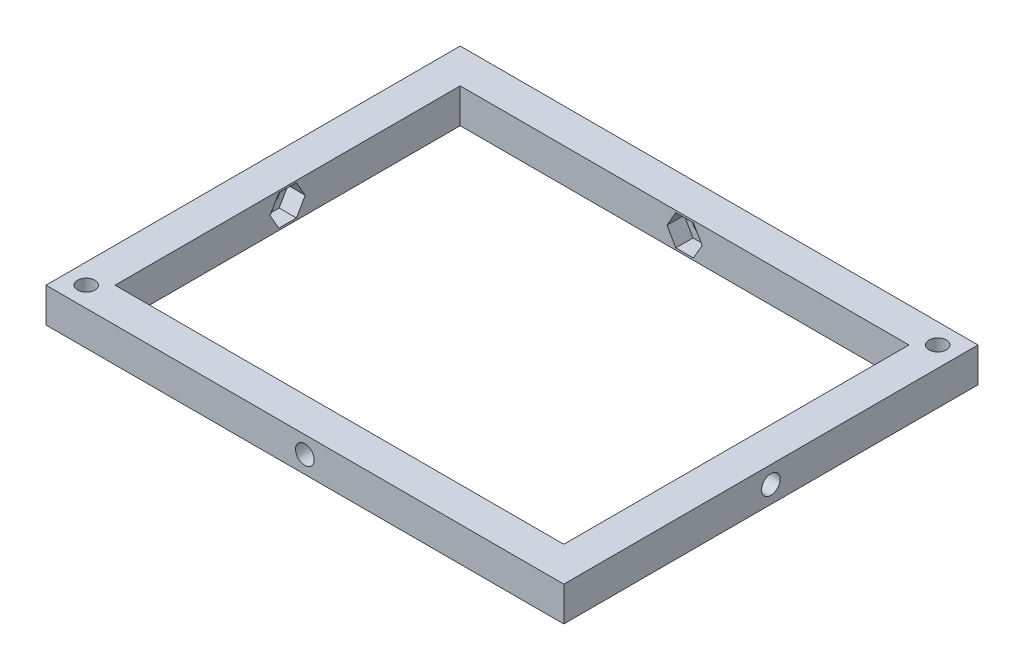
ISO-10303-21;
HEADER;
FILE_DESCRIPTION(('STEP AP214'),'2;1');
FILE_NAME('part.step','',(''),(''),'','','');
FILE_SCHEMA(('AUTOMOTIVE_DESIGN { 1 0 10303 214 1 1 1 1 }'));
ENDSEC;
DATA;
#1=APPLICATION_CONTEXT('core data for automotive mechanical design processes');
#2=APPLICATION_PROTOCOL_DEFINITION('international standard','automotive_design',2000,#1);
#3=PRODUCT_CONTEXT('',#1,'mechanical');
#4=PRODUCT('Part','Part','',(#3));
#5=PRODUCT_RELATED_PRODUCT_CATEGORY('part','',(#4));
#6=PRODUCT_DEFINITION_FORMATION('','',#4);
#7=PRODUCT_DEFINITION_CONTEXT('part definition',#1,'design');
#8=PRODUCT_DEFINITION('design','',#6,#7);
#9=PRODUCT_DEFINITION_SHAPE('','',#8);
#10=(LENGTH_UNIT() NAMED_UNIT(*) SI_UNIT(.MILLI.,.METRE.));
#11=(NAMED_UNIT(*) PLANE_ANGLE_UNIT() SI_UNIT($,.RADIAN.));
#12=(NAMED_UNIT(*) SI_UNIT($,.STERADIAN.) SOLID_ANGLE_UNIT());
#13=UNCERTAINTY_MEASURE_WITH_UNIT(LENGTH_MEASURE(1.E-05),#10,'distance_accuracy_value','');
#14=(GEOMETRIC_REPRESENTATION_CONTEXT(3) GLOBAL_UNCERTAINTY_ASSIGNED_CONTEXT((#13)) GLOBAL_UNIT_ASSIGNED_CONTEXT((#10,
#11,#12)) REPRESENTATION_CONTEXT('',''));
#15=CARTESIAN_POINT('',(0.,0.,0.));
#16=DIRECTION('',(0.,0.,1.));
#17=DIRECTION('',(1.,0.,0.));
#18=AXIS2_PLACEMENT_3D('',#15,#16,#17);
#19=CARTESIAN_POINT('',(-39.,0.,-30.));
#20=DIRECTION('',(0.,0.,-1.));
#21=DIRECTION('',(-1.,0.,0.));
#22=AXIS2_PLACEMENT_3D('',#19,#20,#21);
#23=PLANE('',#22);
#24=DIRECTION('',(-1.,0.,0.));
#25=VECTOR('',#24,1.);
#26=CARTESIAN_POINT('',(-39.,6.,-30.));
#27=LINE('',#26,#25);
#28=CARTESIAN_POINT('',(39.,6.,-30.));
#29=VERTEX_POINT('',#28);
#30=CARTESIAN_POINT('',(-39.,6.,-30.));
#31=VERTEX_POINT('',#30);
#32=EDGE_CURVE('E732',#29,#31,#27,.T.);
#33=ORIENTED_EDGE('',*,*,#32,.T.);
#34=DIRECTION('',(0.,1.,0.));
#35=VECTOR('',#34,1.);
#36=CARTESIAN_POINT('',(-39.,0.,-30.));
#37=LINE('',#36,#35);
#38=CARTESIAN_POINT('',(-39.,0.,-30.));
#39=VERTEX_POINT('',#38);
#40=EDGE_CURVE('E750',#39,#31,#37,.T.);
#41=ORIENTED_EDGE('',*,*,#40,.F.);
#42=DIRECTION('',(-1.,0.,0.));
#43=VECTOR('',#42,1.);
#44=CARTESIAN_POINT('',(-39.,0.,-30.));
#45=LINE('',#44,#43);
#46=CARTESIAN_POINT('',(39.,0.,-30.));
#47=VERTEX_POINT('',#46);
#48=EDGE_CURVE('E716',#47,#39,#45,.T.);
#49=ORIENTED_EDGE('',*,*,#48,.F.);
#50=DIRECTION('',(0.,1.,0.));
#51=VECTOR('',#50,1.);
#52=CARTESIAN_POINT('',(39.,0.,-30.));
#53=LINE('',#52,#51);
#54=EDGE_CURVE('E729',#47,#29,#53,.T.);
#55=ORIENTED_EDGE('',*,*,#54,.T.);
#56=EDGE_LOOP('',(#33,#41,#49,#55));
#57=FACE_BOUND('',#56,.T.);
#58=DIRECTION('',(-1.,0.,0.));
#59=VECTOR('',#58,1.);
#60=CARTESIAN_POINT('',(-39.,0.349999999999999,-30.));
#61=LINE('',#60,#59);
#62=CARTESIAN_POINT('',(1.52997821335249,0.35,-30.));
#63=VERTEX_POINT('',#62);
#64=CARTESIAN_POINT('',(-1.52997821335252,0.349999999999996,-30.));
#65=VERTEX_POINT('',#64);
#66=EDGE_CURVE('E63',#63,#65,#61,.T.);
#67=ORIENTED_EDGE('',*,*,#66,.T.);
#68=DIRECTION('',(-0.5,0.866025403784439,0.));
#69=VECTOR('',#68,1.);
#70=CARTESIAN_POINT('',(-10.7459292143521,16.3124953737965,-30.));
#71=LINE('',#70,#69);
#72=CARTESIAN_POINT('',(-3.05995642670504,3.,-30.));
#73=VERTEX_POINT('',#72);
#74=EDGE_CURVE('E354',#65,#73,#71,.T.);
#75=ORIENTED_EDGE('',*,*,#74,.T.);
#76=DIRECTION('',(0.5,0.866025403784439,0.));
#77=VECTOR('',#76,1.);
#78=CARTESIAN_POINT('',(-13.3440054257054,-14.8124953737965,-30.));
#79=LINE('',#78,#77);
#80=CARTESIAN_POINT('',(-1.52997821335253,5.65,-30.));
#81=VERTEX_POINT('',#80);
#82=EDGE_CURVE('E1458',#73,#81,#79,.T.);
#83=ORIENTED_EDGE('',*,*,#82,.T.);
#84=DIRECTION('',(1.,0.,0.));
#85=VECTOR('',#84,1.);
#86=CARTESIAN_POINT('',(-39.,5.65,-30.));
#87=LINE('',#86,#85);
#88=CARTESIAN_POINT('',(1.5299782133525,5.65,-30.));
#89=VERTEX_POINT('',#88);
#90=EDGE_CURVE('E1453',#81,#89,#87,.T.);
#91=ORIENTED_EDGE('',*,*,#90,.T.);
#92=DIRECTION('',(0.5,-0.866025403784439,0.));
#93=VECTOR('',#92,1.);
#94=CARTESIAN_POINT('',(-6.15599457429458,18.9624953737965,-30.));
#95=LINE('',#94,#93);
#96=CARTESIAN_POINT('',(3.059956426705,3.,-30.));
#97=VERTEX_POINT('',#96);
#98=EDGE_CURVE('E1447',#89,#97,#95,.T.);
#99=ORIENTED_EDGE('',*,*,#98,.T.);
#100=DIRECTION('',(-0.5,-0.866025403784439,0.));
#101=VECTOR('',#100,1.);
#102=CARTESIAN_POINT('',(-8.75407078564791,-17.4624953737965,-30.));
#103=LINE('',#102,#101);
#104=EDGE_CURVE('E350',#97,#63,#103,.T.);
#105=ORIENTED_EDGE('',*,*,#104,.T.);
#106=EDGE_LOOP('',(#67,#75,#83,#91,#99,#105));
#107=FACE_BOUND('',#106,.T.);
#108=ADVANCED_FACE('F45',(#57,#107),#23,.F.);
#109=CARTESIAN_POINT('',(39.,0.,30.));
#110=DIRECTION('',(1.,0.,0.));
#111=DIRECTION('',(0.,0.,-1.));
#112=AXIS2_PLACEMENT_3D('',#109,#110,#111);
#113=PLANE('',#112);
#114=DIRECTION('',(0.,0.,-1.));
#115=VECTOR('',#114,1.);
#116=CARTESIAN_POINT('',(39.,6.,30.));
#117=LINE('',#116,#115);
#118=CARTESIAN_POINT('',(39.,6.,30.));
#119=VERTEX_POINT('',#118);
#120=EDGE_CURVE('E706',#119,#29,#117,.T.);
#121=ORIENTED_EDGE('',*,*,#120,.T.);
#122=ORIENTED_EDGE('',*,*,#54,.F.);
#123=DIRECTION('',(0.,0.,-1.));
#124=VECTOR('',#123,1.);
#125=CARTESIAN_POINT('',(39.,0.,30.));
#126=LINE('',#125,#124);
#127=CARTESIAN_POINT('',(39.,0.,30.));
#128=VERTEX_POINT('',#127);
#129=EDGE_CURVE('E712',#128,#47,#126,.T.);
#130=ORIENTED_EDGE('',*,*,#129,.F.);
#131=DIRECTION('',(0.,1.,0.));
#132=VECTOR('',#131,1.);
#133=CARTESIAN_POINT('',(39.,0.,30.));
#134=LINE('',#133,#132);
#135=EDGE_CURVE('E743',#128,#119,#134,.T.);
#136=ORIENTED_EDGE('',*,*,#135,.T.);
#137=EDGE_LOOP('',(#121,#122,#130,#136));
#138=FACE_BOUND('',#137,.T.);
#139=DIRECTION('',(0.,0.,-1.));
#140=VECTOR('',#139,1.);
#141=CARTESIAN_POINT('',(39.,0.350000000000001,30.));
#142=LINE('',#141,#140);
#143=CARTESIAN_POINT('',(39.,0.35,1.52997821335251));
#144=VERTEX_POINT('',#143);
#145=CARTESIAN_POINT('',(39.,0.350000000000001,-1.52997821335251));
#146=VERTEX_POINT('',#145);
#147=EDGE_CURVE('E71',#144,#146,#142,.T.);
#148=ORIENTED_EDGE('',*,*,#147,.T.);
#149=DIRECTION('',(0.,0.866025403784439,-0.5));
#150=VECTOR('',#149,1.);
#151=CARTESIAN_POINT('',(39.,-13.5653810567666,6.50407078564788));
#152=LINE('',#151,#150);
#153=CARTESIAN_POINT('',(39.,3.,-3.05995642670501));
#154=VERTEX_POINT('',#153);
#155=EDGE_CURVE('E388',#146,#154,#152,.T.);
#156=ORIENTED_EDGE('',*,*,#155,.T.);
#157=DIRECTION('',(0.,0.866025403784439,0.5));
#158=VECTOR('',#157,1.);
#159=CARTESIAN_POINT('',(39.,15.0653810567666,3.90599457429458));
#160=LINE('',#159,#158);
#161=CARTESIAN_POINT('',(39.,5.65,-1.5299782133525));
#162=VERTEX_POINT('',#161);
#163=EDGE_CURVE('E392',#154,#162,#160,.T.);
#164=ORIENTED_EDGE('',*,*,#163,.T.);
#165=DIRECTION('',(0.,0.,1.));
#166=VECTOR('',#165,1.);
#167=CARTESIAN_POINT('',(39.,5.65,30.));
#168=LINE('',#167,#166);
#169=CARTESIAN_POINT('',(39.,5.65,1.52997821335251));
#170=VERTEX_POINT('',#169);
#171=EDGE_CURVE('E396',#162,#170,#168,.T.);
#172=ORIENTED_EDGE('',*,*,#171,.T.);
#173=DIRECTION('',(0.,-0.866025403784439,0.5));
#174=VECTOR('',#173,1.);
#175=CARTESIAN_POINT('',(39.,-10.9153810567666,11.0940054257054));
#176=LINE('',#175,#174);
#177=CARTESIAN_POINT('',(39.,3.,3.05995642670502));
#178=VERTEX_POINT('',#177);
#179=EDGE_CURVE('E400',#170,#178,#176,.T.);
#180=ORIENTED_EDGE('',*,*,#179,.T.);
#181=DIRECTION('',(0.,-0.866025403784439,-0.5));
#182=VECTOR('',#181,1.);
#183=CARTESIAN_POINT('',(39.,12.4153810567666,8.4959292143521));
#184=LINE('',#183,#182);
#185=EDGE_CURVE('E370',#178,#144,#184,.T.);
#186=ORIENTED_EDGE('',*,*,#185,.T.);
#187=EDGE_LOOP('',(#148,#156,#164,#172,#180,#186));
#188=FACE_BOUND('',#187,.T.);
#189=ADVANCED_FACE('F827',(#138,#188),#113,.F.);
#190=CARTESIAN_POINT('',(-39.,0.,30.));
#191=DIRECTION('',(-1.,0.,0.));
#192=DIRECTION('',(0.,0.,1.));
#193=AXIS2_PLACEMENT_3D('',#190,#191,#192);
#194=PLANE('',#193);
#195=DIRECTION('',(0.,0.,1.));
#196=VECTOR('',#195,1.);
#197=CARTESIAN_POINT('',(-39.,6.,30.));
#198=LINE('',#197,#196);
#199=CARTESIAN_POINT('',(-39.,6.,30.));
#200=VERTEX_POINT('',#199);
#201=EDGE_CURVE('E736',#31,#200,#198,.T.);
#202=ORIENTED_EDGE('',*,*,#201,.T.);
#203=DIRECTION('',(0.,1.,0.));
#204=VECTOR('',#203,1.);
#205=CARTESIAN_POINT('',(-39.,0.,30.));
#206=LINE('',#205,#204);
#207=CARTESIAN_POINT('',(-39.,0.,30.));
#208=VERTEX_POINT('',#207);
#209=EDGE_CURVE('E747',#208,#200,#206,.T.);
#210=ORIENTED_EDGE('',*,*,#209,.F.);
#211=DIRECTION('',(0.,0.,1.));
#212=VECTOR('',#211,1.);
#213=CARTESIAN_POINT('',(-39.,0.,30.));
#214=LINE('',#213,#212);
#215=EDGE_CURVE('E721',#39,#208,#214,.T.);
#216=ORIENTED_EDGE('',*,*,#215,.F.);
#217=ORIENTED_EDGE('',*,*,#40,.T.);
#218=EDGE_LOOP('',(#202,#210,#216,#217));
#219=FACE_BOUND('',#218,.T.);
#220=DIRECTION('',(0.,0.866025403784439,-0.5));
#221=VECTOR('',#220,1.);
#222=CARTESIAN_POINT('',(-39.,-10.9153810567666,11.0940054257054));
#223=LINE('',#222,#221);
#224=CARTESIAN_POINT('',(-39.,3.,3.05995642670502));
#225=VERTEX_POINT('',#224);
#226=CARTESIAN_POINT('',(-39.,5.65,1.52997821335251));
#227=VERTEX_POINT('',#226);
#228=EDGE_CURVE('E446',#225,#227,#223,.T.);
#229=ORIENTED_EDGE('',*,*,#228,.T.);
#230=DIRECTION('',(0.,0.,-1.));
#231=VECTOR('',#230,1.);
#232=CARTESIAN_POINT('',(-39.,5.65,30.));
#233=LINE('',#232,#231);
#234=CARTESIAN_POINT('',(-39.,5.65,-1.5299782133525));
#235=VERTEX_POINT('',#234);
#236=EDGE_CURVE('E450',#227,#235,#233,.T.);
#237=ORIENTED_EDGE('',*,*,#236,.T.);
#238=DIRECTION('',(0.,-0.866025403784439,-0.5));
#239=VECTOR('',#238,1.);
#240=CARTESIAN_POINT('',(-39.,15.0653810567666,3.90599457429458));
#241=LINE('',#240,#239);
#242=CARTESIAN_POINT('',(-39.,3.,-3.05995642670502));
#243=VERTEX_POINT('',#242);
#244=EDGE_CURVE('E454',#235,#243,#241,.T.);
#245=ORIENTED_EDGE('',*,*,#244,.T.);
#246=DIRECTION('',(0.,-0.866025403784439,0.5));
#247=VECTOR('',#246,1.);
#248=CARTESIAN_POINT('',(-39.,-13.5653810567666,6.50407078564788));
#249=LINE('',#248,#247);
#250=CARTESIAN_POINT('',(-39.,0.350000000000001,-1.52997821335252));
#251=VERTEX_POINT('',#250);
#252=EDGE_CURVE('E458',#243,#251,#249,.T.);
#253=ORIENTED_EDGE('',*,*,#252,.T.);
#254=DIRECTION('',(0.,0.,1.));
#255=VECTOR('',#254,1.);
#256=CARTESIAN_POINT('',(-39.,0.350000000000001,30.));
#257=LINE('',#256,#255);
#258=CARTESIAN_POINT('',(-39.,0.35,1.52997821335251));
#259=VERTEX_POINT('',#258);
#260=EDGE_CURVE('E462',#251,#259,#257,.T.);
#261=ORIENTED_EDGE('',*,*,#260,.T.);
#262=DIRECTION('',(0.,0.866025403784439,0.5));
#263=VECTOR('',#262,1.);
#264=CARTESIAN_POINT('',(-39.,12.4153810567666,8.4959292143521));
#265=LINE('',#264,#263);
#266=EDGE_CURVE('E430',#259,#225,#265,.T.);
#267=ORIENTED_EDGE('',*,*,#266,.T.);
#268=EDGE_LOOP('',(#229,#237,#245,#253,#261,#267));
#269=FACE_BOUND('',#268,.T.);
#270=ADVANCED_FACE('F833',(#219,#269),#194,.F.);
#271=CARTESIAN_POINT('',(-39.,0.,30.));
#272=DIRECTION('',(0.,0.,1.));
#273=DIRECTION('',(1.,0.,0.));
#274=AXIS2_PLACEMENT_3D('',#271,#272,#273);
#275=PLANE('',#274);
#276=DIRECTION('',(1.,0.,0.));
#277=VECTOR('',#276,1.);
#278=CARTESIAN_POINT('',(-39.,6.,30.));
#279=LINE('',#278,#277);
#280=EDGE_CURVE('E717',#200,#119,#279,.T.);
#281=ORIENTED_EDGE('',*,*,#280,.T.);
#282=ORIENTED_EDGE('',*,*,#135,.F.);
#283=DIRECTION('',(1.,0.,0.));
#284=VECTOR('',#283,1.);
#285=CARTESIAN_POINT('',(-39.,0.,30.));
#286=LINE('',#285,#284);
#287=EDGE_CURVE('E725',#208,#128,#286,.T.);
#288=ORIENTED_EDGE('',*,*,#287,.F.);
#289=ORIENTED_EDGE('',*,*,#209,.T.);
#290=EDGE_LOOP('',(#281,#282,#288,#289));
#291=FACE_BOUND('',#290,.T.);
#292=DIRECTION('',(-0.5,0.866025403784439,0.));
#293=VECTOR('',#292,1.);
#294=CARTESIAN_POINT('',(-6.15599457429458,18.9624953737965,30.));
#295=LINE('',#294,#293);
#296=CARTESIAN_POINT('',(3.059956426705,3.00000000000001,30.));
#297=VERTEX_POINT('',#296);
#298=CARTESIAN_POINT('',(1.5299782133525,5.65,30.));
#299=VERTEX_POINT('',#298);
#300=EDGE_CURVE('E510',#297,#299,#295,.T.);
#301=ORIENTED_EDGE('',*,*,#300,.T.);
#302=DIRECTION('',(-1.,0.,0.));
#303=VECTOR('',#302,1.);
#304=CARTESIAN_POINT('',(-39.,5.65,30.));
#305=LINE('',#304,#303);
#306=CARTESIAN_POINT('',(-1.52997821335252,5.65000000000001,30.));
#307=VERTEX_POINT('',#306);
#308=EDGE_CURVE('E514',#299,#307,#305,.T.);
#309=ORIENTED_EDGE('',*,*,#308,.T.);
#310=DIRECTION('',(-0.5,-0.866025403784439,0.));
#311=VECTOR('',#310,1.);
#312=CARTESIAN_POINT('',(-13.3440054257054,-14.8124953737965,30.));
#313=LINE('',#312,#311);
#314=CARTESIAN_POINT('',(-3.05995642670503,3.,30.));
#315=VERTEX_POINT('',#314);
#316=EDGE_CURVE('E518',#307,#315,#313,.T.);
#317=ORIENTED_EDGE('',*,*,#316,.T.);
#318=DIRECTION('',(0.5,-0.866025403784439,0.));
#319=VECTOR('',#318,1.);
#320=CARTESIAN_POINT('',(-10.7459292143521,16.3124953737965,30.));
#321=LINE('',#320,#319);
#322=CARTESIAN_POINT('',(-1.52997821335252,0.35,30.));
#323=VERTEX_POINT('',#322);
#324=EDGE_CURVE('E522',#315,#323,#321,.T.);
#325=ORIENTED_EDGE('',*,*,#324,.T.);
#326=DIRECTION('',(1.,0.,0.));
#327=VECTOR('',#326,1.);
#328=CARTESIAN_POINT('',(-39.,0.349999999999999,30.));
#329=LINE('',#328,#327);
#330=CARTESIAN_POINT('',(1.52997821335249,0.350000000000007,30.));
#331=VERTEX_POINT('',#330);
#332=EDGE_CURVE('E526',#323,#331,#329,.T.);
#333=ORIENTED_EDGE('',*,*,#332,.T.);
#334=DIRECTION('',(0.5,0.866025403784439,0.));
#335=VECTOR('',#334,1.);
#336=CARTESIAN_POINT('',(-8.75407078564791,-17.4624953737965,30.));
#337=LINE('',#336,#335);
#338=EDGE_CURVE('E494',#331,#297,#337,.T.);
#339=ORIENTED_EDGE('',*,*,#338,.T.);
#340=EDGE_LOOP('',(#301,#309,#317,#325,#333,#339));
#341=FACE_BOUND('',#340,.T.);
#342=ADVANCED_FACE('F958',(#291,#341),#275,.F.);
#343=CARTESIAN_POINT('',(-41.5,0.,32.5));
#344=DIRECTION('',(0.,1.,0.));
#345=DIRECTION('',(0.,0.,1.));
#346=AXIS2_PLACEMENT_3D('',#343,#344,#345);
#347=CYLINDRICAL_SURFACE('',#346,1.5);
#348=CARTESIAN_POINT('',(-41.5,6.,32.5));
#349=DIRECTION('',(0.,1.,0.));
#350=DIRECTION('',(0.,0.,1.));
#351=AXIS2_PLACEMENT_3D('',#348,#349,#350);
#352=CIRCLE('',#351,1.5);
#353=CARTESIAN_POINT('',(-41.5,6.,34.));
#354=VERTEX_POINT('',#353);
#355=EDGE_CURVE('E702',#354,#354,#352,.T.);
#356=ORIENTED_EDGE('',*,*,#355,.T.);
#357=EDGE_LOOP('',(#356));
#358=FACE_BOUND('',#357,.T.);
#359=CARTESIAN_POINT('',(-41.5,3.,32.5));
#360=DIRECTION('',(0.,-1.,0.));
#361=DIRECTION('',(0.,0.,-1.));
#362=AXIS2_PLACEMENT_3D('',#359,#360,#361);
#363=CIRCLE('',#362,1.5);
#364=CARTESIAN_POINT('',(-41.5,3.,31.));
#365=VERTEX_POINT('',#364);
#366=EDGE_CURVE('E711',#365,#365,#363,.F.);
#367=ORIENTED_EDGE('',*,*,#366,.F.);
#368=EDGE_LOOP('',(#367));
#369=FACE_BOUND('',#368,.T.);
#370=ADVANCED_FACE('F955',(#358,#369),#347,.F.);
#371=CARTESIAN_POINT('',(41.5,0.,-32.5));
#372=DIRECTION('',(0.,1.,0.));
#373=DIRECTION('',(0.,0.,1.));
#374=AXIS2_PLACEMENT_3D('',#371,#372,#373);
#375=CYLINDRICAL_SURFACE('',#374,1.5);
#376=CARTESIAN_POINT('',(41.5,6.,-32.5));
#377=DIRECTION('',(0.,1.,0.));
#378=DIRECTION('',(0.,0.,1.));
#379=AXIS2_PLACEMENT_3D('',#376,#377,#378);
#380=CIRCLE('',#379,1.5);
#381=CARTESIAN_POINT('',(41.5,6.,-31.));
#382=VERTEX_POINT('',#381);
#383=EDGE_CURVE('E707',#382,#382,#380,.T.);
#384=ORIENTED_EDGE('',*,*,#383,.T.);
#385=EDGE_LOOP('',(#384));
#386=FACE_BOUND('',#385,.T.);
#387=CARTESIAN_POINT('',(41.5,3.,-32.5));
#388=DIRECTION('',(0.,-1.,0.));
#389=DIRECTION('',(0.,0.,-1.));
#390=AXIS2_PLACEMENT_3D('',#387,#388,#389);
#391=CIRCLE('',#390,1.5);
#392=CARTESIAN_POINT('',(41.5,3.,-34.));
#393=VERTEX_POINT('',#392);
#394=EDGE_CURVE('E619',#393,#393,#391,.F.);
#395=ORIENTED_EDGE('',*,*,#394,.F.);
#396=EDGE_LOOP('',(#395));
#397=FACE_BOUND('',#396,.T.);
#398=ADVANCED_FACE('F862',(#386,#397),#375,.F.);
#399=CARTESIAN_POINT('',(45.,6.,36.));
#400=DIRECTION('',(-1.,0.,0.));
#401=DIRECTION('',(0.,0.,1.));
#402=AXIS2_PLACEMENT_3D('',#399,#400,#401);
#403=PLANE('',#402);
#404=CARTESIAN_POINT('',(45.,3.,0.));
#405=DIRECTION('',(1.,0.,0.));
#406=DIRECTION('',(0.,0.,-1.));
#407=AXIS2_PLACEMENT_3D('',#404,#405,#406);
#408=CIRCLE('',#407,1.625);
#409=CARTESIAN_POINT('',(45.,3.,-1.62499999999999));
#410=VERTEX_POINT('',#409);
#411=EDGE_CURVE('E558',#410,#410,#408,.T.);
#412=ORIENTED_EDGE('',*,*,#411,.F.);
#413=EDGE_LOOP('',(#412));
#414=FACE_BOUND('',#413,.T.);
#415=DIRECTION('',(0.,0.,-1.));
#416=VECTOR('',#415,1.);
#417=CARTESIAN_POINT('',(45.,0.,36.));
#418=LINE('',#417,#416);
#419=CARTESIAN_POINT('',(45.,0.,36.));
#420=VERTEX_POINT('',#419);
#421=CARTESIAN_POINT('',(45.,0.,-36.));
#422=VERTEX_POINT('',#421);
#423=EDGE_CURVE('E746',#420,#422,#418,.T.);
#424=ORIENTED_EDGE('',*,*,#423,.T.);
#425=DIRECTION('',(0.,-1.,0.));
#426=VECTOR('',#425,1.);
#427=CARTESIAN_POINT('',(45.,6.,-36.));
#428=LINE('',#427,#426);
#429=CARTESIAN_POINT('',(45.,6.,-36.));
#430=VERTEX_POINT('',#429);
#431=EDGE_CURVE('E12',#430,#422,#428,.T.);
#432=ORIENTED_EDGE('',*,*,#431,.F.);
#433=DIRECTION('',(0.,0.,-1.));
#434=VECTOR('',#433,1.);
#435=CARTESIAN_POINT('',(45.,6.,36.));
#436=LINE('',#435,#434);
#437=CARTESIAN_POINT('',(45.,6.,36.));
#438=VERTEX_POINT('',#437);
#439=EDGE_CURVE('E756',#438,#430,#436,.T.);
#440=ORIENTED_EDGE('',*,*,#439,.F.);
#441=DIRECTION('',(0.,-1.,0.));
#442=VECTOR('',#441,1.);
#443=CARTESIAN_POINT('',(45.,6.,36.));
#444=LINE('',#443,#442);
#445=EDGE_CURVE('E769',#438,#420,#444,.T.);
#446=ORIENTED_EDGE('',*,*,#445,.T.);
#447=EDGE_LOOP('',(#424,#432,#440,#446));
#448=FACE_BOUND('',#447,.T.);
#449=ADVANCED_FACE('F47',(#414,#448),#403,.F.);
#450=CARTESIAN_POINT('',(-45.,6.,-36.));
#451=DIRECTION('',(0.,0.,1.));
#452=DIRECTION('',(1.,0.,0.));
#453=AXIS2_PLACEMENT_3D('',#450,#451,#452);
#454=PLANE('',#453);
#455=CARTESIAN_POINT('',(0.,3.,-36.));
#456=DIRECTION('',(0.,0.,1.));
#457=DIRECTION('',(1.,0.,0.));
#458=AXIS2_PLACEMENT_3D('',#455,#456,#457);
#459=CIRCLE('',#458,1.625);
#460=CARTESIAN_POINT('',(1.625,3.,-36.));
#461=VERTEX_POINT('',#460);
#462=EDGE_CURVE('E562',#461,#461,#459,.T.);
#463=ORIENTED_EDGE('',*,*,#462,.T.);
#464=EDGE_LOOP('',(#463));
#465=FACE_BOUND('',#464,.T.);
#466=DIRECTION('',(-1.,0.,0.));
#467=VECTOR('',#466,1.);
#468=CARTESIAN_POINT('',(-45.,0.,-36.));
#469=LINE('',#468,#467);
#470=CARTESIAN_POINT('',(-45.,0.,-36.));
#471=VERTEX_POINT('',#470);
#472=EDGE_CURVE('E772',#422,#471,#469,.T.);
#473=ORIENTED_EDGE('',*,*,#472,.T.);
#474=DIRECTION('',(0.,-1.,0.));
#475=VECTOR('',#474,1.);
#476=CARTESIAN_POINT('',(-45.,6.,-36.));
#477=LINE('',#476,#475);
#478=CARTESIAN_POINT('',(-45.,6.,-36.));
#479=VERTEX_POINT('',#478);
#480=EDGE_CURVE('E55',#479,#471,#477,.T.);
#481=ORIENTED_EDGE('',*,*,#480,.F.);
#482=DIRECTION('',(-1.,0.,0.));
#483=VECTOR('',#482,1.);
#484=CARTESIAN_POINT('',(-45.,6.,-36.));
#485=LINE('',#484,#483);
#486=EDGE_CURVE('E759',#430,#479,#485,.T.);
#487=ORIENTED_EDGE('',*,*,#486,.F.);
#488=ORIENTED_EDGE('',*,*,#431,.T.);
#489=EDGE_LOOP('',(#473,#481,#487,#488));
#490=FACE_BOUND('',#489,.T.);
#491=ADVANCED_FACE('F855',(#465,#490),#454,.F.);
#492=CARTESIAN_POINT('',(-45.,6.,36.));
#493=DIRECTION('',(1.,0.,0.));
#494=DIRECTION('',(0.,0.,-1.));
#495=AXIS2_PLACEMENT_3D('',#492,#493,#494);
#496=PLANE('',#495);
#497=CARTESIAN_POINT('',(-45.,3.,0.));
#498=DIRECTION('',(1.,0.,0.));
#499=DIRECTION('',(0.,0.,-1.));
#500=AXIS2_PLACEMENT_3D('',#497,#498,#499);
#501=CIRCLE('',#500,1.625);
#502=CARTESIAN_POINT('',(-45.,3.,-1.62499999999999));
#503=VERTEX_POINT('',#502);
#504=EDGE_CURVE('E553',#503,#503,#501,.T.);
#505=ORIENTED_EDGE('',*,*,#504,.T.);
#506=EDGE_LOOP('',(#505));
#507=FACE_BOUND('',#506,.T.);
#508=DIRECTION('',(0.,-1.,0.));
#509=VECTOR('',#508,1.);
#510=CARTESIAN_POINT('',(-45.,6.,36.));
#511=LINE('',#510,#509);
#512=CARTESIAN_POINT('',(-45.,6.,36.));
#513=VERTEX_POINT('',#512);
#514=CARTESIAN_POINT('',(-45.,0.,36.));
#515=VERTEX_POINT('',#514);
#516=EDGE_CURVE('E783',#513,#515,#511,.T.);
#517=ORIENTED_EDGE('',*,*,#516,.F.);
#518=DIRECTION('',(0.,0.,1.));
#519=VECTOR('',#518,1.);
#520=CARTESIAN_POINT('',(-45.,6.,36.));
#521=LINE('',#520,#519);
#522=EDGE_CURVE('E763',#479,#513,#521,.T.);
#523=ORIENTED_EDGE('',*,*,#522,.F.);
#524=ORIENTED_EDGE('',*,*,#480,.T.);
#525=DIRECTION('',(0.,0.,1.));
#526=VECTOR('',#525,1.);
#527=CARTESIAN_POINT('',(-45.,0.,36.));
#528=LINE('',#527,#526);
#529=EDGE_CURVE('E775',#471,#515,#528,.T.);
#530=ORIENTED_EDGE('',*,*,#529,.T.);
#531=EDGE_LOOP('',(#517,#523,#524,#530));
#532=FACE_BOUND('',#531,.T.);
#533=ADVANCED_FACE('F852',(#507,#532),#496,.F.);
#534=CARTESIAN_POINT('',(-45.,6.,36.));
#535=DIRECTION('',(0.,0.,-1.));
#536=DIRECTION('',(-1.,0.,0.));
#537=AXIS2_PLACEMENT_3D('',#534,#535,#536);
#538=PLANE('',#537);
#539=CARTESIAN_POINT('',(0.,3.,36.));
#540=DIRECTION('',(0.,0.,1.));
#541=DIRECTION('',(1.,0.,0.));
#542=AXIS2_PLACEMENT_3D('',#539,#540,#541);
#543=CIRCLE('',#542,1.625);
#544=CARTESIAN_POINT('',(1.625,3.,36.));
#545=VERTEX_POINT('',#544);
#546=EDGE_CURVE('E557',#545,#545,#543,.T.);
#547=ORIENTED_EDGE('',*,*,#546,.F.);
#548=EDGE_LOOP('',(#547));
#549=FACE_BOUND('',#548,.T.);
#550=DIRECTION('',(1.,0.,0.));
#551=VECTOR('',#550,1.);
#552=CARTESIAN_POINT('',(-45.,0.,36.));
#553=LINE('',#552,#551);
#554=EDGE_CURVE('E760',#515,#420,#553,.T.);
#555=ORIENTED_EDGE('',*,*,#554,.T.);
#556=ORIENTED_EDGE('',*,*,#445,.F.);
#557=DIRECTION('',(1.,0.,0.));
#558=VECTOR('',#557,1.);
#559=CARTESIAN_POINT('',(-45.,6.,36.));
#560=LINE('',#559,#558);
#561=EDGE_CURVE('E766',#513,#438,#560,.T.);
#562=ORIENTED_EDGE('',*,*,#561,.F.);
#563=ORIENTED_EDGE('',*,*,#516,.T.);
#564=EDGE_LOOP('',(#555,#556,#562,#563));
#565=FACE_BOUND('',#564,.T.);
#566=ADVANCED_FACE('F844',(#549,#565),#538,.F.);
#567=CARTESIAN_POINT('',(0.,6.,0.));
#568=DIRECTION('',(0.,-1.,0.));
#569=DIRECTION('',(0.,0.,-1.));
#570=AXIS2_PLACEMENT_3D('',#567,#568,#569);
#571=PLANE('',#570);
#572=ORIENTED_EDGE('',*,*,#383,.F.);
#573=EDGE_LOOP('',(#572));
#574=FACE_BOUND('',#573,.T.);
#575=ORIENTED_EDGE('',*,*,#32,.F.);
#576=ORIENTED_EDGE('',*,*,#120,.F.);
#577=ORIENTED_EDGE('',*,*,#280,.F.);
#578=ORIENTED_EDGE('',*,*,#201,.F.);
#579=EDGE_LOOP('',(#575,#576,#577,#578));
#580=FACE_BOUND('',#579,.T.);
#581=ORIENTED_EDGE('',*,*,#355,.F.);
#582=EDGE_LOOP('',(#581));
#583=FACE_BOUND('',#582,.T.);
#584=ORIENTED_EDGE('',*,*,#439,.T.);
#585=ORIENTED_EDGE('',*,*,#486,.T.);
#586=ORIENTED_EDGE('',*,*,#522,.T.);
#587=ORIENTED_EDGE('',*,*,#561,.T.);
#588=EDGE_LOOP('',(#584,#585,#586,#587));
#589=FACE_BOUND('',#588,.T.);
#590=ADVANCED_FACE('F840',(#574,#580,#583,#589),#571,.F.);
#591=CARTESIAN_POINT('',(0.,0.,0.));
#592=DIRECTION('',(0.,-1.,0.));
#593=DIRECTION('',(0.,0.,-1.));
#594=AXIS2_PLACEMENT_3D('',#591,#592,#593);
#595=PLANE('',#594);
#596=DIRECTION('',(-0.500000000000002,0.,0.866025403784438));
#597=VECTOR('',#596,1.);
#598=CARTESIAN_POINT('',(19.3470545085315,0.,11.1700271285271));
#599=LINE('',#598,#597);
#600=CARTESIAN_POINT('',(44.559956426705,0.,-32.5));
#601=VERTEX_POINT('',#600);
#602=CARTESIAN_POINT('',(43.0299782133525,0.,-29.85));
#603=VERTEX_POINT('',#602);
#604=EDGE_CURVE('E661',#601,#603,#599,.T.);
#605=ORIENTED_EDGE('',*,*,#604,.F.);
#606=DIRECTION('',(0.5,0.,0.866025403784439));
#607=VECTOR('',#606,1.);
#608=CARTESIAN_POINT('',(47.4928801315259,0.,-27.4200271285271));
#609=LINE('',#608,#607);
#610=CARTESIAN_POINT('',(43.0299782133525,0.,-35.15));
#611=VERTEX_POINT('',#610);
#612=EDGE_CURVE('E664',#611,#601,#609,.T.);
#613=ORIENTED_EDGE('',*,*,#612,.F.);
#614=DIRECTION('',(1.,0.,0.));
#615=VECTOR('',#614,1.);
#616=CARTESIAN_POINT('',(0.,0.,-35.15));
#617=LINE('',#616,#615);
#618=CARTESIAN_POINT('',(39.9700217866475,0.,-35.15));
#619=VERTEX_POINT('',#618);
#620=EDGE_CURVE('E668',#619,#611,#617,.T.);
#621=ORIENTED_EDGE('',*,*,#620,.F.);
#622=DIRECTION('',(0.500000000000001,0.,-0.866025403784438));
#623=VECTOR('',#622,1.);
#624=CARTESIAN_POINT('',(14.7571198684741,0.,8.52002712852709));
#625=LINE('',#624,#623);
#626=CARTESIAN_POINT('',(38.440043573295,0.,-32.5));
#627=VERTEX_POINT('',#626);
#628=EDGE_CURVE('E672',#627,#619,#625,.T.);
#629=ORIENTED_EDGE('',*,*,#628,.F.);
#630=DIRECTION('',(-0.500000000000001,0.,-0.866025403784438));
#631=VECTOR('',#630,1.);
#632=CARTESIAN_POINT('',(42.9029454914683,0.,-24.7700271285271));
#633=LINE('',#632,#631);
#634=CARTESIAN_POINT('',(39.9700217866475,0.,-29.85));
#635=VERTEX_POINT('',#634);
#636=EDGE_CURVE('E675',#635,#627,#633,.T.);
#637=ORIENTED_EDGE('',*,*,#636,.F.);
#638=DIRECTION('',(-1.,0.,0.));
#639=VECTOR('',#638,1.);
#640=CARTESIAN_POINT('',(0.,0.,-29.85));
#641=LINE('',#640,#639);
#642=EDGE_CURVE('E600',#603,#635,#641,.T.);
#643=ORIENTED_EDGE('',*,*,#642,.F.);
#644=EDGE_LOOP('',(#605,#613,#621,#629,#637,#643));
#645=FACE_BOUND('',#644,.T.);
#646=ORIENTED_EDGE('',*,*,#129,.T.);
#647=ORIENTED_EDGE('',*,*,#48,.T.);
#648=ORIENTED_EDGE('',*,*,#215,.T.);
#649=ORIENTED_EDGE('',*,*,#287,.T.);
#650=EDGE_LOOP('',(#646,#647,#648,#649));
#651=FACE_BOUND('',#650,.T.);
#652=ORIENTED_EDGE('',*,*,#472,.F.);
#653=ORIENTED_EDGE('',*,*,#423,.F.);
#654=ORIENTED_EDGE('',*,*,#554,.F.);
#655=ORIENTED_EDGE('',*,*,#529,.F.);
#656=EDGE_LOOP('',(#652,#653,#654,#655));
#657=FACE_BOUND('',#656,.T.);
#658=DIRECTION('',(0.5,0.,-0.866025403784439));
#659=VECTOR('',#658,1.);
#660=CARTESIAN_POINT('',(-19.3470545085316,0.,-11.1700271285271));
#661=LINE('',#660,#659);
#662=CARTESIAN_POINT('',(-44.559956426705,0.,32.5));
#663=VERTEX_POINT('',#662);
#664=CARTESIAN_POINT('',(-43.0299782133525,0.,29.85));
#665=VERTEX_POINT('',#664);
#666=EDGE_CURVE('E603',#663,#665,#661,.T.);
#667=ORIENTED_EDGE('',*,*,#666,.F.);
#668=DIRECTION('',(-0.500000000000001,0.,-0.866025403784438));
#669=VECTOR('',#668,1.);
#670=CARTESIAN_POINT('',(-47.4928801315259,0.,27.4200271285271));
#671=LINE('',#670,#669);
#672=CARTESIAN_POINT('',(-43.0299782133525,0.,35.15));
#673=VERTEX_POINT('',#672);
#674=EDGE_CURVE('E599',#673,#663,#671,.T.);
#675=ORIENTED_EDGE('',*,*,#674,.F.);
#676=DIRECTION('',(-1.,0.,0.));
#677=VECTOR('',#676,1.);
#678=CARTESIAN_POINT('',(0.,0.,35.15));
#679=LINE('',#678,#677);
#680=CARTESIAN_POINT('',(-39.9700217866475,0.,35.15));
#681=VERTEX_POINT('',#680);
#682=EDGE_CURVE('E596',#681,#673,#679,.T.);
#683=ORIENTED_EDGE('',*,*,#682,.F.);
#684=DIRECTION('',(-0.5,0.,0.866025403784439));
#685=VECTOR('',#684,1.);
#686=CARTESIAN_POINT('',(-14.7571198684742,0.,-8.52002712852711));
#687=LINE('',#686,#685);
#688=CARTESIAN_POINT('',(-38.440043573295,0.,32.5));
#689=VERTEX_POINT('',#688);
#690=EDGE_CURVE('E575',#689,#681,#687,.T.);
#691=ORIENTED_EDGE('',*,*,#690,.F.);
#692=DIRECTION('',(0.500000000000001,0.,0.866025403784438));
#693=VECTOR('',#692,1.);
#694=CARTESIAN_POINT('',(-42.9029454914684,0.,24.7700271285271));
#695=LINE('',#694,#693);
#696=CARTESIAN_POINT('',(-39.9700217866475,0.,29.85));
#697=VERTEX_POINT('',#696);
#698=EDGE_CURVE('E610',#697,#689,#695,.T.);
#699=ORIENTED_EDGE('',*,*,#698,.F.);
#700=DIRECTION('',(1.,0.,0.));
#701=VECTOR('',#700,1.);
#702=CARTESIAN_POINT('',(0.,0.,29.85));
#703=LINE('',#702,#701);
#704=EDGE_CURVE('E606',#665,#697,#703,.T.);
#705=ORIENTED_EDGE('',*,*,#704,.F.);
#706=EDGE_LOOP('',(#667,#675,#683,#691,#699,#705));
#707=FACE_BOUND('',#706,.T.);
#708=ADVANCED_FACE('F843',(#645,#651,#657,#707),#595,.T.);
#709=CARTESIAN_POINT('',(0.,3.,0.));
#710=DIRECTION('',(0.,-1.,0.));
#711=DIRECTION('',(0.,0.,-1.));
#712=AXIS2_PLACEMENT_3D('',#709,#710,#711);
#713=PLANE('',#712);
#714=DIRECTION('',(-1.,0.,0.));
#715=VECTOR('',#714,1.);
#716=CARTESIAN_POINT('',(0.,3.,-29.85));
#717=LINE('',#716,#715);
#718=CARTESIAN_POINT('',(43.0299782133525,3.,-29.85));
#719=VERTEX_POINT('',#718);
#720=CARTESIAN_POINT('',(39.9700217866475,3.,-29.85));
#721=VERTEX_POINT('',#720);
#722=EDGE_CURVE('E665',#719,#721,#717,.T.);
#723=ORIENTED_EDGE('',*,*,#722,.T.);
#724=DIRECTION('',(-0.500000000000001,0.,-0.866025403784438));
#725=VECTOR('',#724,1.);
#726=CARTESIAN_POINT('',(42.9029454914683,3.,-24.7700271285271));
#727=LINE('',#726,#725);
#728=CARTESIAN_POINT('',(38.440043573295,3.,-32.5));
#729=VERTEX_POINT('',#728);
#730=EDGE_CURVE('E695',#721,#729,#727,.T.);
#731=ORIENTED_EDGE('',*,*,#730,.T.);
#732=DIRECTION('',(0.500000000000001,0.,-0.866025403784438));
#733=VECTOR('',#732,1.);
#734=CARTESIAN_POINT('',(14.7571198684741,3.,8.52002712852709));
#735=LINE('',#734,#733);
#736=CARTESIAN_POINT('',(39.9700217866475,3.,-35.15));
#737=VERTEX_POINT('',#736);
#738=EDGE_CURVE('E691',#729,#737,#735,.T.);
#739=ORIENTED_EDGE('',*,*,#738,.T.);
#740=DIRECTION('',(1.,0.,0.));
#741=VECTOR('',#740,1.);
#742=CARTESIAN_POINT('',(0.,3.,-35.15));
#743=LINE('',#742,#741);
#744=CARTESIAN_POINT('',(43.0299782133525,3.,-35.15));
#745=VERTEX_POINT('',#744);
#746=EDGE_CURVE('E687',#737,#745,#743,.T.);
#747=ORIENTED_EDGE('',*,*,#746,.T.);
#748=DIRECTION('',(0.5,0.,0.866025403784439));
#749=VECTOR('',#748,1.);
#750=CARTESIAN_POINT('',(47.4928801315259,3.,-27.4200271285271));
#751=LINE('',#750,#749);
#752=CARTESIAN_POINT('',(44.559956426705,3.,-32.5));
#753=VERTEX_POINT('',#752);
#754=EDGE_CURVE('E683',#745,#753,#751,.T.);
#755=ORIENTED_EDGE('',*,*,#754,.T.);
#756=DIRECTION('',(-0.500000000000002,0.,0.866025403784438));
#757=VECTOR('',#756,1.);
#758=CARTESIAN_POINT('',(19.3470545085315,3.,11.1700271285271));
#759=LINE('',#758,#757);
#760=EDGE_CURVE('E642',#753,#719,#759,.T.);
#761=ORIENTED_EDGE('',*,*,#760,.T.);
#762=EDGE_LOOP('',(#723,#731,#739,#747,#755,#761));
#763=FACE_BOUND('',#762,.T.);
#764=ORIENTED_EDGE('',*,*,#394,.T.);
#765=EDGE_LOOP('',(#764));
#766=FACE_BOUND('',#765,.T.);
#767=ADVANCED_FACE('F848',(#763,#766),#713,.T.);
#768=CARTESIAN_POINT('',(0.,3.,-29.85));
#769=DIRECTION('',(0.,0.,1.));
#770=DIRECTION('',(1.,0.,0.));
#771=AXIS2_PLACEMENT_3D('',#768,#769,#770);
#772=PLANE('',#771);
#773=ORIENTED_EDGE('',*,*,#642,.T.);
#774=DIRECTION('',(0.,-1.,0.));
#775=VECTOR('',#774,1.);
#776=CARTESIAN_POINT('',(39.9700217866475,3.,-29.85));
#777=LINE('',#776,#775);
#778=EDGE_CURVE('E638',#721,#635,#777,.T.);
#779=ORIENTED_EDGE('',*,*,#778,.F.);
#780=ORIENTED_EDGE('',*,*,#722,.F.);
#781=DIRECTION('',(0.,-1.,0.));
#782=VECTOR('',#781,1.);
#783=CARTESIAN_POINT('',(43.0299782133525,3.,-29.85));
#784=LINE('',#783,#782);
#785=EDGE_CURVE('E566',#719,#603,#784,.T.);
#786=ORIENTED_EDGE('',*,*,#785,.T.);
#787=EDGE_LOOP('',(#773,#779,#780,#786));
#788=FACE_BOUND('',#787,.T.);
#789=ADVANCED_FACE('F928',(#788),#772,.F.);
#790=CARTESIAN_POINT('',(19.3470545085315,3.,11.1700271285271));
#791=DIRECTION('',(0.866025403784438,0.,0.500000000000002));
#792=DIRECTION('',(0.500000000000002,0.,-0.866025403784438));
#793=AXIS2_PLACEMENT_3D('',#790,#791,#792);
#794=PLANE('',#793);
#795=ORIENTED_EDGE('',*,*,#604,.T.);
#796=ORIENTED_EDGE('',*,*,#785,.F.);
#797=ORIENTED_EDGE('',*,*,#760,.F.);
#798=DIRECTION('',(0.,-1.,0.));
#799=VECTOR('',#798,1.);
#800=CARTESIAN_POINT('',(44.559956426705,3.,-32.5));
#801=LINE('',#800,#799);
#802=EDGE_CURVE('E654',#753,#601,#801,.T.);
#803=ORIENTED_EDGE('',*,*,#802,.T.);
#804=EDGE_LOOP('',(#795,#796,#797,#803));
#805=FACE_BOUND('',#804,.T.);
#806=ADVANCED_FACE('F931',(#805),#794,.F.);
#807=CARTESIAN_POINT('',(47.4928801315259,3.,-27.4200271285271));
#808=DIRECTION('',(0.866025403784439,0.,-0.5));
#809=DIRECTION('',(-0.5,0.,-0.866025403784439));
#810=AXIS2_PLACEMENT_3D('',#807,#808,#809);
#811=PLANE('',#810);
#812=ORIENTED_EDGE('',*,*,#612,.T.);
#813=ORIENTED_EDGE('',*,*,#802,.F.);
#814=ORIENTED_EDGE('',*,*,#754,.F.);
#815=DIRECTION('',(0.,-1.,0.));
#816=VECTOR('',#815,1.);
#817=CARTESIAN_POINT('',(43.0299782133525,3.,-35.15));
#818=LINE('',#817,#816);
#819=EDGE_CURVE('E651',#745,#611,#818,.T.);
#820=ORIENTED_EDGE('',*,*,#819,.T.);
#821=EDGE_LOOP('',(#812,#813,#814,#820));
#822=FACE_BOUND('',#821,.T.);
#823=ADVANCED_FACE('F944',(#822),#811,.F.);
#824=CARTESIAN_POINT('',(0.,3.,-35.15));
#825=DIRECTION('',(0.,0.,-1.));
#826=DIRECTION('',(-1.,0.,0.));
#827=AXIS2_PLACEMENT_3D('',#824,#825,#826);
#828=PLANE('',#827);
#829=ORIENTED_EDGE('',*,*,#620,.T.);
#830=ORIENTED_EDGE('',*,*,#819,.F.);
#831=ORIENTED_EDGE('',*,*,#746,.F.);
#832=DIRECTION('',(0.,-1.,0.));
#833=VECTOR('',#832,1.);
#834=CARTESIAN_POINT('',(39.9700217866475,3.,-35.15));
#835=LINE('',#834,#833);
#836=EDGE_CURVE('E647',#737,#619,#835,.T.);
#837=ORIENTED_EDGE('',*,*,#836,.T.);
#838=EDGE_LOOP('',(#829,#830,#831,#837));
#839=FACE_BOUND('',#838,.T.);
#840=ADVANCED_FACE('F940',(#839),#828,.F.);
#841=CARTESIAN_POINT('',(14.7571198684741,3.,8.52002712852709));
#842=DIRECTION('',(-0.866025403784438,0.,-0.500000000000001));
#843=DIRECTION('',(-0.500000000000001,0.,0.866025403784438));
#844=AXIS2_PLACEMENT_3D('',#841,#842,#843);
#845=PLANE('',#844);
#846=ORIENTED_EDGE('',*,*,#628,.T.);
#847=ORIENTED_EDGE('',*,*,#836,.F.);
#848=ORIENTED_EDGE('',*,*,#738,.F.);
#849=DIRECTION('',(0.,-1.,0.));
#850=VECTOR('',#849,1.);
#851=CARTESIAN_POINT('',(38.440043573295,3.,-32.5));
#852=LINE('',#851,#850);
#853=EDGE_CURVE('E643',#729,#627,#852,.T.);
#854=ORIENTED_EDGE('',*,*,#853,.T.);
#855=EDGE_LOOP('',(#846,#847,#848,#854));
#856=FACE_BOUND('',#855,.T.);
#857=ADVANCED_FACE('F936',(#856),#845,.F.);
#858=CARTESIAN_POINT('',(42.9029454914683,3.,-24.7700271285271));
#859=DIRECTION('',(-0.866025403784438,0.,0.500000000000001));
#860=DIRECTION('',(0.500000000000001,0.,0.866025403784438));
#861=AXIS2_PLACEMENT_3D('',#858,#859,#860);
#862=PLANE('',#861);
#863=ORIENTED_EDGE('',*,*,#636,.T.);
#864=ORIENTED_EDGE('',*,*,#853,.F.);
#865=ORIENTED_EDGE('',*,*,#730,.F.);
#866=ORIENTED_EDGE('',*,*,#778,.T.);
#867=EDGE_LOOP('',(#863,#864,#865,#866));
#868=FACE_BOUND('',#867,.T.);
#869=ADVANCED_FACE('F933',(#868),#862,.F.);
#870=CARTESIAN_POINT('',(0.,3.,0.));
#871=DIRECTION('',(0.,-1.,0.));
#872=DIRECTION('',(0.,0.,-1.));
#873=AXIS2_PLACEMENT_3D('',#870,#871,#872);
#874=PLANE('',#873);
#875=DIRECTION('',(-1.,0.,0.));
#876=VECTOR('',#875,1.);
#877=CARTESIAN_POINT('',(0.,3.,35.15));
#878=LINE('',#877,#876);
#879=CARTESIAN_POINT('',(-39.9700217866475,3.,35.15));
#880=VERTEX_POINT('',#879);
#881=CARTESIAN_POINT('',(-43.0299782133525,3.,35.15));
#882=VERTEX_POINT('',#881);
#883=EDGE_CURVE('E570',#880,#882,#878,.T.);
#884=ORIENTED_EDGE('',*,*,#883,.T.);
#885=DIRECTION('',(-0.500000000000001,0.,-0.866025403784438));
#886=VECTOR('',#885,1.);
#887=CARTESIAN_POINT('',(-47.4928801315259,3.,27.4200271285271));
#888=LINE('',#887,#886);
#889=CARTESIAN_POINT('',(-44.559956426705,3.,32.5));
#890=VERTEX_POINT('',#889);
#891=EDGE_CURVE('E574',#882,#890,#888,.T.);
#892=ORIENTED_EDGE('',*,*,#891,.T.);
#893=DIRECTION('',(0.5,0.,-0.866025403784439));
#894=VECTOR('',#893,1.);
#895=CARTESIAN_POINT('',(-19.3470545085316,3.,-11.1700271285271));
#896=LINE('',#895,#894);
#897=CARTESIAN_POINT('',(-43.0299782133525,3.,29.85));
#898=VERTEX_POINT('',#897);
#899=EDGE_CURVE('E579',#890,#898,#896,.T.);
#900=ORIENTED_EDGE('',*,*,#899,.T.);
#901=DIRECTION('',(1.,0.,0.));
#902=VECTOR('',#901,1.);
#903=CARTESIAN_POINT('',(0.,3.,29.85));
#904=LINE('',#903,#902);
#905=CARTESIAN_POINT('',(-39.9700217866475,3.,29.85));
#906=VERTEX_POINT('',#905);
#907=EDGE_CURVE('E583',#898,#906,#904,.T.);
#908=ORIENTED_EDGE('',*,*,#907,.T.);
#909=DIRECTION('',(0.500000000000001,0.,0.866025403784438));
#910=VECTOR('',#909,1.);
#911=CARTESIAN_POINT('',(-42.9029454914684,3.,24.7700271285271));
#912=LINE('',#911,#910);
#913=CARTESIAN_POINT('',(-38.440043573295,3.,32.5));
#914=VERTEX_POINT('',#913);
#915=EDGE_CURVE('E587',#906,#914,#912,.T.);
#916=ORIENTED_EDGE('',*,*,#915,.T.);
#917=DIRECTION('',(-0.5,0.,0.866025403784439));
#918=VECTOR('',#917,1.);
#919=CARTESIAN_POINT('',(-14.7571198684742,3.,-8.52002712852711));
#920=LINE('',#919,#918);
#921=EDGE_CURVE('E591',#914,#880,#920,.T.);
#922=ORIENTED_EDGE('',*,*,#921,.T.);
#923=EDGE_LOOP('',(#884,#892,#900,#908,#916,#922));
#924=FACE_BOUND('',#923,.T.);
#925=ORIENTED_EDGE('',*,*,#366,.T.);
#926=EDGE_LOOP('',(#925));
#927=FACE_BOUND('',#926,.T.);
#928=ADVANCED_FACE('F897',(#924,#927),#874,.T.);
#929=CARTESIAN_POINT('',(0.,3.,35.15));
#930=DIRECTION('',(0.,0.,1.));
#931=DIRECTION('',(1.,0.,0.));
#932=AXIS2_PLACEMENT_3D('',#929,#930,#931);
#933=PLANE('',#932);
#934=ORIENTED_EDGE('',*,*,#682,.T.);
#935=DIRECTION('',(0.,-1.,0.));
#936=VECTOR('',#935,1.);
#937=CARTESIAN_POINT('',(-43.0299782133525,3.,35.15));
#938=LINE('',#937,#936);
#939=EDGE_CURVE('E595',#882,#673,#938,.T.);
#940=ORIENTED_EDGE('',*,*,#939,.F.);
#941=ORIENTED_EDGE('',*,*,#883,.F.);
#942=DIRECTION('',(0.,-1.,0.));
#943=VECTOR('',#942,1.);
#944=CARTESIAN_POINT('',(-39.9700217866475,3.,35.15));
#945=LINE('',#944,#943);
#946=EDGE_CURVE('E615',#880,#681,#945,.T.);
#947=ORIENTED_EDGE('',*,*,#946,.T.);
#948=EDGE_LOOP('',(#934,#940,#941,#947));
#949=FACE_BOUND('',#948,.T.);
#950=ADVANCED_FACE('F904',(#949),#933,.F.);
#951=CARTESIAN_POINT('',(-14.7571198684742,3.,-8.52002712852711));
#952=DIRECTION('',(0.866025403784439,0.,0.499999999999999));
#953=DIRECTION('',(0.499999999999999,0.,-0.866025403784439));
#954=AXIS2_PLACEMENT_3D('',#951,#952,#953);
#955=PLANE('',#954);
#956=ORIENTED_EDGE('',*,*,#690,.T.);
#957=ORIENTED_EDGE('',*,*,#946,.F.);
#958=ORIENTED_EDGE('',*,*,#921,.F.);
#959=DIRECTION('',(0.,-1.,0.));
#960=VECTOR('',#959,1.);
#961=CARTESIAN_POINT('',(-38.440043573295,3.,32.5));
#962=LINE('',#961,#960);
#963=EDGE_CURVE('E620',#914,#689,#962,.T.);
#964=ORIENTED_EDGE('',*,*,#963,.T.);
#965=EDGE_LOOP('',(#956,#957,#958,#964));
#966=FACE_BOUND('',#965,.T.);
#967=ADVANCED_FACE('F907',(#966),#955,.F.);
#968=CARTESIAN_POINT('',(-42.9029454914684,3.,24.7700271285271));
#969=DIRECTION('',(0.866025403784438,0.,-0.500000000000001));
#970=DIRECTION('',(-0.500000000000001,0.,-0.866025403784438));
#971=AXIS2_PLACEMENT_3D('',#968,#969,#970);
#972=PLANE('',#971);
#973=ORIENTED_EDGE('',*,*,#698,.T.);
#974=ORIENTED_EDGE('',*,*,#963,.F.);
#975=ORIENTED_EDGE('',*,*,#915,.F.);
#976=DIRECTION('',(0.,-1.,0.));
#977=VECTOR('',#976,1.);
#978=CARTESIAN_POINT('',(-39.9700217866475,3.,29.85));
#979=LINE('',#978,#977);
#980=EDGE_CURVE('E624',#906,#697,#979,.T.);
#981=ORIENTED_EDGE('',*,*,#980,.T.);
#982=EDGE_LOOP('',(#973,#974,#975,#981));
#983=FACE_BOUND('',#982,.T.);
#984=ADVANCED_FACE('F910',(#983),#972,.F.);
#985=CARTESIAN_POINT('',(0.,3.,29.85));
#986=DIRECTION('',(0.,0.,-1.));
#987=DIRECTION('',(-1.,0.,0.));
#988=AXIS2_PLACEMENT_3D('',#985,#986,#987);
#989=PLANE('',#988);
#990=ORIENTED_EDGE('',*,*,#704,.T.);
#991=ORIENTED_EDGE('',*,*,#980,.F.);
#992=ORIENTED_EDGE('',*,*,#907,.F.);
#993=DIRECTION('',(0.,-1.,0.));
#994=VECTOR('',#993,1.);
#995=CARTESIAN_POINT('',(-43.0299782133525,3.,29.85));
#996=LINE('',#995,#994);
#997=EDGE_CURVE('E627',#898,#665,#996,.T.);
#998=ORIENTED_EDGE('',*,*,#997,.T.);
#999=EDGE_LOOP('',(#990,#991,#992,#998));
#1000=FACE_BOUND('',#999,.T.);
#1001=ADVANCED_FACE('F894',(#1000),#989,.F.);
#1002=CARTESIAN_POINT('',(-19.3470545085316,3.,-11.1700271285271));
#1003=DIRECTION('',(-0.866025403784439,0.,-0.5));
#1004=DIRECTION('',(-0.5,0.,0.866025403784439));
#1005=AXIS2_PLACEMENT_3D('',#1002,#1003,#1004);
#1006=PLANE('',#1005);
#1007=ORIENTED_EDGE('',*,*,#666,.T.);
#1008=ORIENTED_EDGE('',*,*,#997,.F.);
#1009=ORIENTED_EDGE('',*,*,#899,.F.);
#1010=DIRECTION('',(0.,-1.,0.));
#1011=VECTOR('',#1010,1.);
#1012=CARTESIAN_POINT('',(-44.559956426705,3.,32.5));
#1013=LINE('',#1012,#1011);
#1014=EDGE_CURVE('E631',#890,#663,#1013,.T.);
#1015=ORIENTED_EDGE('',*,*,#1014,.T.);
#1016=EDGE_LOOP('',(#1007,#1008,#1009,#1015));
#1017=FACE_BOUND('',#1016,.T.);
#1018=ADVANCED_FACE('F890',(#1017),#1006,.F.);
#1019=CARTESIAN_POINT('',(-47.4928801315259,3.,27.4200271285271));
#1020=DIRECTION('',(-0.866025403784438,0.,0.500000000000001));
#1021=DIRECTION('',(0.500000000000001,0.,0.866025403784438));
#1022=AXIS2_PLACEMENT_3D('',#1019,#1020,#1021);
#1023=PLANE('',#1022);
#1024=ORIENTED_EDGE('',*,*,#674,.T.);
#1025=ORIENTED_EDGE('',*,*,#1014,.F.);
#1026=ORIENTED_EDGE('',*,*,#891,.F.);
#1027=ORIENTED_EDGE('',*,*,#939,.T.);
#1028=EDGE_LOOP('',(#1024,#1025,#1026,#1027));
#1029=FACE_BOUND('',#1028,.T.);
#1030=ADVANCED_FACE('F902',(#1029),#1023,.F.);
#1031=CARTESIAN_POINT('',(0.,3.,-36.));
#1032=DIRECTION('',(0.,0.,1.));
#1033=DIRECTION('',(1.,0.,0.));
#1034=AXIS2_PLACEMENT_3D('',#1031,#1032,#1033);
#1035=CYLINDRICAL_SURFACE('',#1034,1.625);
#1036=CARTESIAN_POINT('',(0.,3.,-33.));
#1037=DIRECTION('',(0.,0.,-1.));
#1038=DIRECTION('',(-1.,0.,0.));
#1039=AXIS2_PLACEMENT_3D('',#1036,#1037,#1038);
#1040=CIRCLE('',#1039,1.625);
#1041=CARTESIAN_POINT('',(-1.625,3.,-33.));
#1042=VERTEX_POINT('',#1041);
#1043=EDGE_CURVE('E49',#1042,#1042,#1040,.F.);
#1044=ORIENTED_EDGE('',*,*,#1043,.T.);
#1045=EDGE_LOOP('',(#1044));
#1046=FACE_BOUND('',#1045,.T.);
#1047=ORIENTED_EDGE('',*,*,#462,.F.);
#1048=EDGE_LOOP('',(#1047));
#1049=FACE_BOUND('',#1048,.T.);
#1050=ADVANCED_FACE('F925',(#1046,#1049),#1035,.F.);
#1051=CARTESIAN_POINT('',(0.,3.,33.));
#1052=DIRECTION('',(0.,0.,1.));
#1053=DIRECTION('',(1.,0.,0.));
#1054=AXIS2_PLACEMENT_3D('',#1051,#1052,#1053);
#1055=CIRCLE('',#1054,1.625);
#1056=CARTESIAN_POINT('',(1.625,3.,33.));
#1057=VERTEX_POINT('',#1056);
#1058=EDGE_CURVE('E552',#1057,#1057,#1055,.F.);
#1059=ORIENTED_EDGE('',*,*,#1058,.T.);
#1060=EDGE_LOOP('',(#1059));
#1061=FACE_BOUND('',#1060,.T.);
#1062=ORIENTED_EDGE('',*,*,#546,.T.);
#1063=EDGE_LOOP('',(#1062));
#1064=FACE_BOUND('',#1063,.T.);
#1065=ADVANCED_FACE('F1021',(#1061,#1064),#1035,.F.);
#1066=CARTESIAN_POINT('',(-45.,3.,0.));
#1067=DIRECTION('',(1.,0.,0.));
#1068=DIRECTION('',(0.,0.,-1.));
#1069=AXIS2_PLACEMENT_3D('',#1066,#1067,#1068);
#1070=CYLINDRICAL_SURFACE('',#1069,1.625);
#1071=CARTESIAN_POINT('',(-42.,3.,0.));
#1072=DIRECTION('',(-1.,0.,0.));
#1073=DIRECTION('',(0.,0.,1.));
#1074=AXIS2_PLACEMENT_3D('',#1071,#1072,#1073);
#1075=CIRCLE('',#1074,1.625);
#1076=CARTESIAN_POINT('',(-42.,3.,-1.62499999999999));
#1077=VERTEX_POINT('',#1076);
#1078=EDGE_CURVE('E488',#1077,#1077,#1075,.F.);
#1079=CARTESIAN_POINT('',(-42.,3.,-1.62499999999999));
#1080=CARTESIAN_POINT('',(-42.03125,3.,-1.62499999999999));
#1081=CARTESIAN_POINT('',(-42.0625,3.,-1.62499999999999));
#1082=CARTESIAN_POINT('',(-42.125,3.,-1.62499999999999));
#1083=CARTESIAN_POINT('',(-42.15625,3.,-1.62499999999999));
#1084=CARTESIAN_POINT('',(-42.21875,3.,-1.62499999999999));
#1085=CARTESIAN_POINT('',(-42.25,3.,-1.62499999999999));
#1086=CARTESIAN_POINT('',(-42.3125,3.,-1.62499999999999));
#1087=CARTESIAN_POINT('',(-42.34375,3.,-1.62499999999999));
#1088=CARTESIAN_POINT('',(-42.40625,3.,-1.62499999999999));
#1089=CARTESIAN_POINT('',(-42.4375,3.,-1.62499999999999));
#1090=CARTESIAN_POINT('',(-42.5,3.,-1.62499999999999));
#1091=CARTESIAN_POINT('',(-42.53125,3.,-1.62499999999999));
#1092=CARTESIAN_POINT('',(-42.59375,3.,-1.62499999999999));
#1093=CARTESIAN_POINT('',(-42.625,3.,-1.62499999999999));
#1094=CARTESIAN_POINT('',(-42.6875,3.,-1.62499999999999));
#1095=CARTESIAN_POINT('',(-42.71875,3.,-1.62499999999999));
#1096=CARTESIAN_POINT('',(-42.78125,3.,-1.62499999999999));
#1097=CARTESIAN_POINT('',(-42.8125,3.,-1.62499999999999));
#1098=CARTESIAN_POINT('',(-42.875,3.,-1.62499999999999));
#1099=CARTESIAN_POINT('',(-42.90625,3.,-1.62499999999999));
#1100=CARTESIAN_POINT('',(-42.96875,3.,-1.62499999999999));
#1101=CARTESIAN_POINT('',(-43.,3.,-1.62499999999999));
#1102=CARTESIAN_POINT('',(-43.0625,3.,-1.62499999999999));
#1103=CARTESIAN_POINT('',(-43.09375,3.,-1.62499999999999));
#1104=CARTESIAN_POINT('',(-43.15625,3.,-1.62499999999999));
#1105=CARTESIAN_POINT('',(-43.1875,3.,-1.62499999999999));
#1106=CARTESIAN_POINT('',(-43.25,3.,-1.62499999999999));
#1107=CARTESIAN_POINT('',(-43.28125,3.,-1.62499999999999));
#1108=CARTESIAN_POINT('',(-43.34375,3.,-1.62499999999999));
#1109=CARTESIAN_POINT('',(-43.375,3.,-1.62499999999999));
#1110=CARTESIAN_POINT('',(-43.4375,3.,-1.62499999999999));
#1111=CARTESIAN_POINT('',(-43.46875,3.,-1.62499999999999));
#1112=CARTESIAN_POINT('',(-43.53125,3.,-1.62499999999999));
#1113=CARTESIAN_POINT('',(-43.5625,3.,-1.62499999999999));
#1114=CARTESIAN_POINT('',(-43.625,3.,-1.62499999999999));
#1115=CARTESIAN_POINT('',(-43.65625,3.,-1.62499999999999));
#1116=CARTESIAN_POINT('',(-43.71875,3.,-1.62499999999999));
#1117=CARTESIAN_POINT('',(-43.75,3.,-1.62499999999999));
#1118=CARTESIAN_POINT('',(-43.8125,3.,-1.62499999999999));
#1119=CARTESIAN_POINT('',(-43.84375,3.,-1.62499999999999));
#1120=CARTESIAN_POINT('',(-43.90625,3.,-1.62499999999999));
#1121=CARTESIAN_POINT('',(-43.9375,3.,-1.62499999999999));
#1122=CARTESIAN_POINT('',(-44.,3.,-1.62499999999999));
#1123=CARTESIAN_POINT('',(-44.03125,3.,-1.62499999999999));
#1124=CARTESIAN_POINT('',(-44.09375,3.,-1.62499999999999));
#1125=CARTESIAN_POINT('',(-44.125,3.,-1.62499999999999));
#1126=CARTESIAN_POINT('',(-44.1875,3.,-1.62499999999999));
#1127=CARTESIAN_POINT('',(-44.21875,3.,-1.62499999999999));
#1128=CARTESIAN_POINT('',(-44.28125,3.,-1.62499999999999));
#1129=CARTESIAN_POINT('',(-44.3125,3.,-1.62499999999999));
#1130=CARTESIAN_POINT('',(-44.375,3.,-1.62499999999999));
#1131=CARTESIAN_POINT('',(-44.40625,3.,-1.62499999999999));
#1132=CARTESIAN_POINT('',(-44.46875,3.,-1.62499999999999));
#1133=CARTESIAN_POINT('',(-44.5,3.,-1.62499999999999));
#1134=CARTESIAN_POINT('',(-44.5625,3.,-1.62499999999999));
#1135=CARTESIAN_POINT('',(-44.59375,3.,-1.62499999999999));
#1136=CARTESIAN_POINT('',(-44.65625,3.,-1.62499999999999));
#1137=CARTESIAN_POINT('',(-44.6875,3.,-1.62499999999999));
#1138=CARTESIAN_POINT('',(-44.75,3.,-1.62499999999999));
#1139=CARTESIAN_POINT('',(-44.78125,3.,-1.62499999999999));
#1140=CARTESIAN_POINT('',(-44.84375,3.,-1.62499999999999));
#1141=CARTESIAN_POINT('',(-44.875,3.,-1.62499999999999));
#1142=CARTESIAN_POINT('',(-44.9375,3.,-1.62499999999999));
#1143=CARTESIAN_POINT('',(-44.96875,3.,-1.62499999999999));
#1144=CARTESIAN_POINT('',(-45.,3.,-1.62499999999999));
#1145=B_SPLINE_CURVE_WITH_KNOTS('',3,(#1079,#1080,#1081,#1082,#1083,#1084,#1085,#1086,#1087,
#1088,#1089,#1090,#1091,#1092,#1093,#1094,#1095,#1096,#1097,#1098,#1099,#1100,#1101,#1102,#1103,
#1104,#1105,#1106,#1107,#1108,#1109,#1110,#1111,#1112,#1113,#1114,#1115,#1116,#1117,#1118,#1119,
#1120,#1121,#1122,#1123,#1124,#1125,#1126,#1127,#1128,#1129,#1130,#1131,#1132,#1133,#1134,#1135,
#1136,#1137,#1138,#1139,#1140,#1141,#1142,#1143,#1144),.UNSPECIFIED.,.F.,.F.,(4,2,2,2,2,2,2,2,2,
2,2,2,2,2,2,2,2,2,2,2,2,2,2,2,2,2,2,2,2,2,2,2,4),(0.,0.0937500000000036,0.1875,
0.281250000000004,0.375000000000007,0.468750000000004,0.562500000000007,0.656250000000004,
0.750000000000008,0.843750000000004,0.937500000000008,1.03125,1.12500000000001,1.21875,
1.31250000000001,1.40625,1.50000000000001,1.59375000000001,1.68750000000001,1.78125000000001,
1.87500000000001,1.96875000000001,2.06250000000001,2.15625000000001,2.25000000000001,
2.34375000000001,2.43750000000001,2.53125000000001,2.62500000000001,2.71875000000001,
2.81250000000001,2.90625000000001,3.00000000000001),.UNSPECIFIED.);
#1146=EDGE_CURVE('BSEAM1020',#1077,#503,#1145,.T.);
#1147=ORIENTED_EDGE('',*,*,#1078,.T.);
#1148=ORIENTED_EDGE('',*,*,#504,.F.);
#1149=ORIENTED_EDGE('',*,*,#1146,.T.);
#1150=ORIENTED_EDGE('',*,*,#1146,.F.);
#1151=EDGE_LOOP('',(#1147,#1149,#1148,#1150));
#1152=FACE_BOUND('',#1151,.T.);
#1153=ADVANCED_FACE('F1020',(#1152),#1070,.F.);
#1154=CARTESIAN_POINT('',(42.,3.,0.));
#1155=DIRECTION('',(1.,0.,0.));
#1156=DIRECTION('',(0.,0.,-1.));
#1157=AXIS2_PLACEMENT_3D('',#1154,#1155,#1156);
#1158=CIRCLE('',#1157,1.625);
#1159=CARTESIAN_POINT('',(42.,3.,-1.62499999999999));
#1160=VERTEX_POINT('',#1159);
#1161=EDGE_CURVE('E424',#1160,#1160,#1158,.F.);
#1162=CARTESIAN_POINT('',(42.,3.,-1.62499999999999));
#1163=CARTESIAN_POINT('',(42.03125,3.,-1.62499999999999));
#1164=CARTESIAN_POINT('',(42.0625,3.,-1.62499999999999));
#1165=CARTESIAN_POINT('',(42.125,3.,-1.62499999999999));
#1166=CARTESIAN_POINT('',(42.15625,3.,-1.62499999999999));
#1167=CARTESIAN_POINT('',(42.21875,3.,-1.62499999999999));
#1168=CARTESIAN_POINT('',(42.25,3.,-1.62499999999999));
#1169=CARTESIAN_POINT('',(42.3125,3.,-1.62499999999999));
#1170=CARTESIAN_POINT('',(42.34375,3.,-1.62499999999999));
#1171=CARTESIAN_POINT('',(42.40625,3.,-1.62499999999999));
#1172=CARTESIAN_POINT('',(42.4375,3.,-1.62499999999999));
#1173=CARTESIAN_POINT('',(42.5,3.,-1.62499999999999));
#1174=CARTESIAN_POINT('',(42.53125,3.,-1.62499999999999));
#1175=CARTESIAN_POINT('',(42.59375,3.,-1.62499999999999));
#1176=CARTESIAN_POINT('',(42.625,3.,-1.62499999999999));
#1177=CARTESIAN_POINT('',(42.6875,3.,-1.62499999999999));
#1178=CARTESIAN_POINT('',(42.71875,3.,-1.62499999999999));
#1179=CARTESIAN_POINT('',(42.78125,3.,-1.62499999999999));
#1180=CARTESIAN_POINT('',(42.8125,3.,-1.62499999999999));
#1181=CARTESIAN_POINT('',(42.875,3.,-1.62499999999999));
#1182=CARTESIAN_POINT('',(42.90625,3.,-1.62499999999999));
#1183=CARTESIAN_POINT('',(42.96875,3.,-1.62499999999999));
#1184=CARTESIAN_POINT('',(43.,3.,-1.62499999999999));
#1185=CARTESIAN_POINT('',(43.0625,3.,-1.62499999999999));
#1186=CARTESIAN_POINT('',(43.09375,3.,-1.62499999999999));
#1187=CARTESIAN_POINT('',(43.15625,3.,-1.62499999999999));
#1188=CARTESIAN_POINT('',(43.1875,3.,-1.62499999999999));
#1189=CARTESIAN_POINT('',(43.25,3.,-1.62499999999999));
#1190=CARTESIAN_POINT('',(43.28125,3.,-1.62499999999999));
#1191=CARTESIAN_POINT('',(43.34375,3.,-1.62499999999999));
#1192=CARTESIAN_POINT('',(43.375,3.,-1.62499999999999));
#1193=CARTESIAN_POINT('',(43.4375,3.,-1.62499999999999));
#1194=CARTESIAN_POINT('',(43.46875,3.,-1.62499999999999));
#1195=CARTESIAN_POINT('',(43.53125,3.,-1.62499999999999));
#1196=CARTESIAN_POINT('',(43.5625,3.,-1.62499999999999));
#1197=CARTESIAN_POINT('',(43.625,3.,-1.62499999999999));
#1198=CARTESIAN_POINT('',(43.65625,3.,-1.62499999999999));
#1199=CARTESIAN_POINT('',(43.71875,3.,-1.62499999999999));
#1200=CARTESIAN_POINT('',(43.75,3.,-1.62499999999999));
#1201=CARTESIAN_POINT('',(43.8125,3.,-1.62499999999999));
#1202=CARTESIAN_POINT('',(43.84375,3.,-1.62499999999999));
#1203=CARTESIAN_POINT('',(43.90625,3.,-1.62499999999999));
#1204=CARTESIAN_POINT('',(43.9375,3.,-1.62499999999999));
#1205=CARTESIAN_POINT('',(44.,3.,-1.62499999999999));
#1206=CARTESIAN_POINT('',(44.03125,3.,-1.62499999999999));
#1207=CARTESIAN_POINT('',(44.09375,3.,-1.62499999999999));
#1208=CARTESIAN_POINT('',(44.125,3.,-1.62499999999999));
#1209=CARTESIAN_POINT('',(44.1875,3.,-1.62499999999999));
#1210=CARTESIAN_POINT('',(44.21875,3.,-1.62499999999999));
#1211=CARTESIAN_POINT('',(44.28125,3.,-1.62499999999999));
#1212=CARTESIAN_POINT('',(44.3125,3.,-1.62499999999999));
#1213=CARTESIAN_POINT('',(44.375,3.,-1.62499999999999));
#1214=CARTESIAN_POINT('',(44.40625,3.,-1.62499999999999));
#1215=CARTESIAN_POINT('',(44.46875,3.,-1.62499999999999));
#1216=CARTESIAN_POINT('',(44.5,3.,-1.62499999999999));
#1217=CARTESIAN_POINT('',(44.5625,3.,-1.62499999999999));
#1218=CARTESIAN_POINT('',(44.59375,3.,-1.62499999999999));
#1219=CARTESIAN_POINT('',(44.65625,3.,-1.62499999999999));
#1220=CARTESIAN_POINT('',(44.6875,3.,-1.62499999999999));
#1221=CARTESIAN_POINT('',(44.75,3.,-1.62499999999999));
#1222=CARTESIAN_POINT('',(44.78125,3.,-1.62499999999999));
#1223=CARTESIAN_POINT('',(44.84375,3.,-1.62499999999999));
#1224=CARTESIAN_POINT('',(44.875,3.,-1.62499999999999));
#1225=CARTESIAN_POINT('',(44.9375,3.,-1.62499999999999));
#1226=CARTESIAN_POINT('',(44.96875,3.,-1.62499999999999));
#1227=CARTESIAN_POINT('',(45.,3.,-1.62499999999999));
#1228=B_SPLINE_CURVE_WITH_KNOTS('',3,(#1162,#1163,#1164,#1165,#1166,#1167,#1168,#1169,#1170,
#1171,#1172,#1173,#1174,#1175,#1176,#1177,#1178,#1179,#1180,#1181,#1182,#1183,#1184,#1185,#1186,
#1187,#1188,#1189,#1190,#1191,#1192,#1193,#1194,#1195,#1196,#1197,#1198,#1199,#1200,#1201,#1202,
#1203,#1204,#1205,#1206,#1207,#1208,#1209,#1210,#1211,#1212,#1213,#1214,#1215,#1216,#1217,#1218,
#1219,#1220,#1221,#1222,#1223,#1224,#1225,#1226,#1227),.UNSPECIFIED.,.F.,.F.,(4,2,2,2,2,2,2,2,2,
2,2,2,2,2,2,2,2,2,2,2,2,2,2,2,2,2,2,2,2,2,2,2,4),(0.,0.0937500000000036,0.187499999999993,
0.281249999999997,0.375,0.46874999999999,0.562499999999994,0.656249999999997,0.750000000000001,
0.84374999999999,0.937499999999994,1.03125,1.12499999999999,1.21874999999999,1.31249999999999,
1.40624999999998,1.49999999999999,1.59374999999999,1.68749999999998,1.78124999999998,
1.87499999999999,1.96874999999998,2.06249999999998,2.15624999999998,2.24999999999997,
2.34374999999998,2.43749999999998,2.53124999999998,2.62499999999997,2.71874999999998,
2.81249999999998,2.90624999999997,2.99999999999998),.UNSPECIFIED.);
#1229=EDGE_CURVE('BSEAM805',#1160,#410,#1228,.T.);
#1230=ORIENTED_EDGE('',*,*,#1161,.T.);
#1231=ORIENTED_EDGE('',*,*,#411,.T.);
#1232=ORIENTED_EDGE('',*,*,#1229,.T.);
#1233=ORIENTED_EDGE('',*,*,#1229,.F.);
#1234=EDGE_LOOP('',(#1230,#1232,#1231,#1233));
#1235=FACE_BOUND('',#1234,.T.);
#1236=ADVANCED_FACE('F805',(#1235),#1070,.F.);
#1237=CARTESIAN_POINT('',(0.,0.,33.));
#1238=DIRECTION('',(0.,0.,1.));
#1239=DIRECTION('',(1.,0.,0.));
#1240=AXIS2_PLACEMENT_3D('',#1237,#1238,#1239);
#1241=PLANE('',#1240);
#1242=DIRECTION('',(-0.5,0.866025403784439,0.));
#1243=VECTOR('',#1242,1.);
#1244=CARTESIAN_POINT('',(-6.15599457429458,18.9624953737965,33.));
#1245=LINE('',#1244,#1243);
#1246=CARTESIAN_POINT('',(3.059956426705,3.00000000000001,33.));
#1247=VERTEX_POINT('',#1246);
#1248=CARTESIAN_POINT('',(1.5299782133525,5.65,33.));
#1249=VERTEX_POINT('',#1248);
#1250=EDGE_CURVE('E489',#1247,#1249,#1245,.T.);
#1251=ORIENTED_EDGE('',*,*,#1250,.F.);
#1252=DIRECTION('',(0.5,0.866025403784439,0.));
#1253=VECTOR('',#1252,1.);
#1254=CARTESIAN_POINT('',(-8.75407078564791,-17.4624953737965,33.));
#1255=LINE('',#1254,#1253);
#1256=CARTESIAN_POINT('',(1.52997821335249,0.350000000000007,33.));
#1257=VERTEX_POINT('',#1256);
#1258=EDGE_CURVE('E506',#1257,#1247,#1255,.T.);
#1259=ORIENTED_EDGE('',*,*,#1258,.F.);
#1260=DIRECTION('',(1.,0.,0.));
#1261=VECTOR('',#1260,1.);
#1262=CARTESIAN_POINT('',(-39.,0.349999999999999,33.));
#1263=LINE('',#1262,#1261);
#1264=CARTESIAN_POINT('',(-1.52997821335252,0.35,33.));
#1265=VERTEX_POINT('',#1264);
#1266=EDGE_CURVE('E503',#1265,#1257,#1263,.T.);
#1267=ORIENTED_EDGE('',*,*,#1266,.F.);
#1268=DIRECTION('',(0.5,-0.866025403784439,0.));
#1269=VECTOR('',#1268,1.);
#1270=CARTESIAN_POINT('',(-10.7459292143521,16.3124953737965,33.));
#1271=LINE('',#1270,#1269);
#1272=CARTESIAN_POINT('',(-3.05995642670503,3.,33.));
#1273=VERTEX_POINT('',#1272);
#1274=EDGE_CURVE('E500',#1273,#1265,#1271,.T.);
#1275=ORIENTED_EDGE('',*,*,#1274,.F.);
#1276=DIRECTION('',(-0.5,-0.866025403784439,0.));
#1277=VECTOR('',#1276,1.);
#1278=CARTESIAN_POINT('',(-13.3440054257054,-14.8124953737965,33.));
#1279=LINE('',#1278,#1277);
#1280=CARTESIAN_POINT('',(-1.52997821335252,5.65000000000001,33.));
#1281=VERTEX_POINT('',#1280);
#1282=EDGE_CURVE('E497',#1281,#1273,#1279,.T.);
#1283=ORIENTED_EDGE('',*,*,#1282,.F.);
#1284=DIRECTION('',(-1.,0.,0.));
#1285=VECTOR('',#1284,1.);
#1286=CARTESIAN_POINT('',(-39.,5.65,33.));
#1287=LINE('',#1286,#1285);
#1288=EDGE_CURVE('E493',#1249,#1281,#1287,.T.);
#1289=ORIENTED_EDGE('',*,*,#1288,.F.);
#1290=EDGE_LOOP('',(#1251,#1259,#1267,#1275,#1283,#1289));
#1291=FACE_BOUND('',#1290,.T.);
#1292=ORIENTED_EDGE('',*,*,#1058,.F.);
#1293=EDGE_LOOP('',(#1292));
#1294=FACE_BOUND('',#1293,.T.);
#1295=ADVANCED_FACE('F983',(#1291,#1294),#1241,.F.);
#1296=CARTESIAN_POINT('',(-6.15599457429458,18.9624953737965,33.));
#1297=DIRECTION('',(-0.866025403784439,-0.5,0.));
#1298=DIRECTION('',(0.5,-0.866025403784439,0.));
#1299=AXIS2_PLACEMENT_3D('',#1296,#1297,#1298);
#1300=PLANE('',#1299);
#1301=ORIENTED_EDGE('',*,*,#300,.F.);
#1302=DIRECTION('',(0.,0.,-1.));
#1303=VECTOR('',#1302,1.);
#1304=CARTESIAN_POINT('',(3.059956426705,3.00000000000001,33.));
#1305=LINE('',#1304,#1303);
#1306=EDGE_CURVE('E509',#1247,#297,#1305,.T.);
#1307=ORIENTED_EDGE('',*,*,#1306,.F.);
#1308=ORIENTED_EDGE('',*,*,#1250,.T.);
#1309=DIRECTION('',(0.,0.,-1.));
#1310=VECTOR('',#1309,1.);
#1311=CARTESIAN_POINT('',(1.5299782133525,5.65,33.));
#1312=LINE('',#1311,#1310);
#1313=EDGE_CURVE('E548',#1249,#299,#1312,.T.);
#1314=ORIENTED_EDGE('',*,*,#1313,.T.);
#1315=EDGE_LOOP('',(#1301,#1307,#1308,#1314));
#1316=FACE_BOUND('',#1315,.T.);
#1317=ADVANCED_FACE('F974',(#1316),#1300,.T.);
#1318=CARTESIAN_POINT('',(-39.,5.65,33.));
#1319=DIRECTION('',(0.,-1.,0.));
#1320=DIRECTION('',(0.,0.,-1.));
#1321=AXIS2_PLACEMENT_3D('',#1318,#1319,#1320);
#1322=PLANE('',#1321);
#1323=ORIENTED_EDGE('',*,*,#308,.F.);
#1324=ORIENTED_EDGE('',*,*,#1313,.F.);
#1325=ORIENTED_EDGE('',*,*,#1288,.T.);
#1326=DIRECTION('',(0.,0.,-1.));
#1327=VECTOR('',#1326,1.);
#1328=CARTESIAN_POINT('',(-1.52997821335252,5.65000000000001,33.));
#1329=LINE('',#1328,#1327);
#1330=EDGE_CURVE('E545',#1281,#307,#1329,.T.);
#1331=ORIENTED_EDGE('',*,*,#1330,.T.);
#1332=EDGE_LOOP('',(#1323,#1324,#1325,#1331));
#1333=FACE_BOUND('',#1332,.T.);
#1334=ADVANCED_FACE('F988',(#1333),#1322,.T.);
#1335=CARTESIAN_POINT('',(-13.3440054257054,-14.8124953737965,33.));
#1336=DIRECTION('',(0.866025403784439,-0.5,0.));
#1337=DIRECTION('',(0.5,0.866025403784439,0.));
#1338=AXIS2_PLACEMENT_3D('',#1335,#1336,#1337);
#1339=PLANE('',#1338);
#1340=ORIENTED_EDGE('',*,*,#316,.F.);
#1341=ORIENTED_EDGE('',*,*,#1330,.F.);
#1342=ORIENTED_EDGE('',*,*,#1282,.T.);
#1343=DIRECTION('',(0.,0.,-1.));
#1344=VECTOR('',#1343,1.);
#1345=CARTESIAN_POINT('',(-3.05995642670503,3.,33.));
#1346=LINE('',#1345,#1344);
#1347=EDGE_CURVE('E542',#1273,#315,#1346,.T.);
#1348=ORIENTED_EDGE('',*,*,#1347,.T.);
#1349=EDGE_LOOP('',(#1340,#1341,#1342,#1348));
#1350=FACE_BOUND('',#1349,.T.);
#1351=ADVANCED_FACE('F992',(#1350),#1339,.T.);
#1352=CARTESIAN_POINT('',(-10.7459292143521,16.3124953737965,33.));
#1353=DIRECTION('',(0.866025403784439,0.5,0.));
#1354=DIRECTION('',(-0.5,0.866025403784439,0.));
#1355=AXIS2_PLACEMENT_3D('',#1352,#1353,#1354);
#1356=PLANE('',#1355);
#1357=ORIENTED_EDGE('',*,*,#324,.F.);
#1358=ORIENTED_EDGE('',*,*,#1347,.F.);
#1359=ORIENTED_EDGE('',*,*,#1274,.T.);
#1360=DIRECTION('',(0.,0.,-1.));
#1361=VECTOR('',#1360,1.);
#1362=CARTESIAN_POINT('',(-1.52997821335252,0.35,33.));
#1363=LINE('',#1362,#1361);
#1364=EDGE_CURVE('E539',#1265,#323,#1363,.T.);
#1365=ORIENTED_EDGE('',*,*,#1364,.T.);
#1366=EDGE_LOOP('',(#1357,#1358,#1359,#1365));
#1367=FACE_BOUND('',#1366,.T.);
#1368=ADVANCED_FACE('F997',(#1367),#1356,.T.);
#1369=CARTESIAN_POINT('',(-39.,0.349999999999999,33.));
#1370=DIRECTION('',(0.,1.,0.));
#1371=DIRECTION('',(-1.,0.,0.));
#1372=AXIS2_PLACEMENT_3D('',#1369,#1370,#1371);
#1373=PLANE('',#1372);
#1374=ORIENTED_EDGE('',*,*,#332,.F.);
#1375=ORIENTED_EDGE('',*,*,#1364,.F.);
#1376=ORIENTED_EDGE('',*,*,#1266,.T.);
#1377=DIRECTION('',(0.,0.,-1.));
#1378=VECTOR('',#1377,1.);
#1379=CARTESIAN_POINT('',(1.52997821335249,0.350000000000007,33.));
#1380=LINE('',#1379,#1378);
#1381=EDGE_CURVE('E536',#1257,#331,#1380,.T.);
#1382=ORIENTED_EDGE('',*,*,#1381,.T.);
#1383=EDGE_LOOP('',(#1374,#1375,#1376,#1382));
#1384=FACE_BOUND('',#1383,.T.);
#1385=ADVANCED_FACE('F1000',(#1384),#1373,.T.);
#1386=CARTESIAN_POINT('',(-8.75407078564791,-17.4624953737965,33.));
#1387=DIRECTION('',(-0.866025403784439,0.5,0.));
#1388=DIRECTION('',(-0.5,-0.866025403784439,0.));
#1389=AXIS2_PLACEMENT_3D('',#1386,#1387,#1388);
#1390=PLANE('',#1389);
#1391=ORIENTED_EDGE('',*,*,#338,.F.);
#1392=ORIENTED_EDGE('',*,*,#1381,.F.);
#1393=ORIENTED_EDGE('',*,*,#1258,.T.);
#1394=ORIENTED_EDGE('',*,*,#1306,.T.);
#1395=EDGE_LOOP('',(#1391,#1392,#1393,#1394));
#1396=FACE_BOUND('',#1395,.T.);
#1397=ADVANCED_FACE('F978',(#1396),#1390,.T.);
#1398=CARTESIAN_POINT('',(-42.,0.,0.));
#1399=DIRECTION('',(-1.,0.,0.));
#1400=DIRECTION('',(0.,0.,1.));
#1401=AXIS2_PLACEMENT_3D('',#1398,#1399,#1400);
#1402=PLANE('',#1401);
#1403=DIRECTION('',(0.,0.866025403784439,-0.5));
#1404=VECTOR('',#1403,1.);
#1405=CARTESIAN_POINT('',(-42.,-10.9153810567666,11.0940054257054));
#1406=LINE('',#1405,#1404);
#1407=CARTESIAN_POINT('',(-42.,3.,3.05995642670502));
#1408=VERTEX_POINT('',#1407);
#1409=CARTESIAN_POINT('',(-42.,5.65,1.52997821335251));
#1410=VERTEX_POINT('',#1409);
#1411=EDGE_CURVE('E425',#1408,#1410,#1406,.T.);
#1412=ORIENTED_EDGE('',*,*,#1411,.F.);
#1413=DIRECTION('',(0.,0.866025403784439,0.5));
#1414=VECTOR('',#1413,1.);
#1415=CARTESIAN_POINT('',(-42.,12.4153810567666,8.4959292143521));
#1416=LINE('',#1415,#1414);
#1417=CARTESIAN_POINT('',(-42.,0.35,1.52997821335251));
#1418=VERTEX_POINT('',#1417);
#1419=EDGE_CURVE('E442',#1418,#1408,#1416,.T.);
#1420=ORIENTED_EDGE('',*,*,#1419,.F.);
#1421=DIRECTION('',(0.,0.,1.));
#1422=VECTOR('',#1421,1.);
#1423=CARTESIAN_POINT('',(-42.,0.350000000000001,30.));
#1424=LINE('',#1423,#1422);
#1425=CARTESIAN_POINT('',(-42.,0.350000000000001,-1.52997821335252));
#1426=VERTEX_POINT('',#1425);
#1427=EDGE_CURVE('E439',#1426,#1418,#1424,.T.);
#1428=ORIENTED_EDGE('',*,*,#1427,.F.);
#1429=DIRECTION('',(0.,-0.866025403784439,0.5));
#1430=VECTOR('',#1429,1.);
#1431=CARTESIAN_POINT('',(-42.,-13.5653810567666,6.50407078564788));
#1432=LINE('',#1431,#1430);
#1433=CARTESIAN_POINT('',(-42.,3.,-3.05995642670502));
#1434=VERTEX_POINT('',#1433);
#1435=EDGE_CURVE('E436',#1434,#1426,#1432,.T.);
#1436=ORIENTED_EDGE('',*,*,#1435,.F.);
#1437=DIRECTION('',(0.,-0.866025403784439,-0.5));
#1438=VECTOR('',#1437,1.);
#1439=CARTESIAN_POINT('',(-42.,15.0653810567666,3.90599457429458));
#1440=LINE('',#1439,#1438);
#1441=CARTESIAN_POINT('',(-42.,5.65,-1.5299782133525));
#1442=VERTEX_POINT('',#1441);
#1443=EDGE_CURVE('E433',#1442,#1434,#1440,.T.);
#1444=ORIENTED_EDGE('',*,*,#1443,.F.);
#1445=DIRECTION('',(0.,0.,-1.));
#1446=VECTOR('',#1445,1.);
#1447=CARTESIAN_POINT('',(-42.,5.65,30.));
#1448=LINE('',#1447,#1446);
#1449=EDGE_CURVE('E429',#1410,#1442,#1448,.T.);
#1450=ORIENTED_EDGE('',*,*,#1449,.F.);
#1451=EDGE_LOOP('',(#1412,#1420,#1428,#1436,#1444,#1450));
#1452=FACE_BOUND('',#1451,.T.);
#1453=ORIENTED_EDGE('',*,*,#1078,.F.);
#1454=EDGE_LOOP('',(#1453));
#1455=FACE_BOUND('',#1454,.T.);
#1456=ADVANCED_FACE('F1007',(#1452,#1455),#1402,.F.);
#1457=CARTESIAN_POINT('',(-42.,-10.9153810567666,11.0940054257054));
#1458=DIRECTION('',(0.,-0.5,-0.866025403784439));
#1459=DIRECTION('',(0.,0.866025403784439,-0.5));
#1460=AXIS2_PLACEMENT_3D('',#1457,#1458,#1459);
#1461=PLANE('',#1460);
#1462=ORIENTED_EDGE('',*,*,#228,.F.);
#1463=DIRECTION('',(1.,0.,0.));
#1464=VECTOR('',#1463,1.);
#1465=CARTESIAN_POINT('',(-42.,3.,3.05995642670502));
#1466=LINE('',#1465,#1464);
#1467=EDGE_CURVE('E445',#1408,#225,#1466,.T.);
#1468=ORIENTED_EDGE('',*,*,#1467,.F.);
#1469=ORIENTED_EDGE('',*,*,#1411,.T.);
#1470=DIRECTION('',(1.,0.,0.));
#1471=VECTOR('',#1470,1.);
#1472=CARTESIAN_POINT('',(-42.,5.65,1.52997821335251));
#1473=LINE('',#1472,#1471);
#1474=EDGE_CURVE('E484',#1410,#227,#1473,.T.);
#1475=ORIENTED_EDGE('',*,*,#1474,.T.);
#1476=EDGE_LOOP('',(#1462,#1468,#1469,#1475));
#1477=FACE_BOUND('',#1476,.T.);
#1478=ADVANCED_FACE('F1147',(#1477),#1461,.T.);
#1479=CARTESIAN_POINT('',(-42.,5.65,30.));
#1480=DIRECTION('',(0.,-1.,0.));
#1481=DIRECTION('',(0.,0.,-1.));
#1482=AXIS2_PLACEMENT_3D('',#1479,#1480,#1481);
#1483=PLANE('',#1482);
#1484=ORIENTED_EDGE('',*,*,#236,.F.);
#1485=ORIENTED_EDGE('',*,*,#1474,.F.);
#1486=ORIENTED_EDGE('',*,*,#1449,.T.);
#1487=DIRECTION('',(1.,0.,0.));
#1488=VECTOR('',#1487,1.);
#1489=CARTESIAN_POINT('',(-42.,5.65,-1.5299782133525));
#1490=LINE('',#1489,#1488);
#1491=EDGE_CURVE('E481',#1442,#235,#1490,.T.);
#1492=ORIENTED_EDGE('',*,*,#1491,.T.);
#1493=EDGE_LOOP('',(#1484,#1485,#1486,#1492));
#1494=FACE_BOUND('',#1493,.T.);
#1495=ADVANCED_FACE('F1157',(#1494),#1483,.T.);
#1496=CARTESIAN_POINT('',(-42.,15.0653810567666,3.90599457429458));
#1497=DIRECTION('',(0.,-0.5,0.866025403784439));
#1498=DIRECTION('',(0.,-0.866025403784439,-0.5));
#1499=AXIS2_PLACEMENT_3D('',#1496,#1497,#1498);
#1500=PLANE('',#1499);
#1501=ORIENTED_EDGE('',*,*,#244,.F.);
#1502=ORIENTED_EDGE('',*,*,#1491,.F.);
#1503=ORIENTED_EDGE('',*,*,#1443,.T.);
#1504=DIRECTION('',(1.,0.,0.));
#1505=VECTOR('',#1504,1.);
#1506=CARTESIAN_POINT('',(-42.,3.,-3.05995642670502));
#1507=LINE('',#1506,#1505);
#1508=EDGE_CURVE('E478',#1434,#243,#1507,.T.);
#1509=ORIENTED_EDGE('',*,*,#1508,.T.);
#1510=EDGE_LOOP('',(#1501,#1502,#1503,#1509));
#1511=FACE_BOUND('',#1510,.T.);
#1512=ADVANCED_FACE('F1168',(#1511),#1500,.T.);
#1513=CARTESIAN_POINT('',(-42.,-13.5653810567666,6.50407078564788));
#1514=DIRECTION('',(0.,0.5,0.866025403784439));
#1515=DIRECTION('',(0.,-0.866025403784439,0.5));
#1516=AXIS2_PLACEMENT_3D('',#1513,#1514,#1515);
#1517=PLANE('',#1516);
#1518=ORIENTED_EDGE('',*,*,#252,.F.);
#1519=ORIENTED_EDGE('',*,*,#1508,.F.);
#1520=ORIENTED_EDGE('',*,*,#1435,.T.);
#1521=DIRECTION('',(1.,0.,0.));
#1522=VECTOR('',#1521,1.);
#1523=CARTESIAN_POINT('',(-42.,0.350000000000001,-1.52997821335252));
#1524=LINE('',#1523,#1522);
#1525=EDGE_CURVE('E475',#1426,#251,#1524,.T.);
#1526=ORIENTED_EDGE('',*,*,#1525,.T.);
#1527=EDGE_LOOP('',(#1518,#1519,#1520,#1526));
#1528=FACE_BOUND('',#1527,.T.);
#1529=ADVANCED_FACE('F1179',(#1528),#1517,.T.);
#1530=CARTESIAN_POINT('',(-42.,0.350000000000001,30.));
#1531=DIRECTION('',(0.,1.,0.));
#1532=DIRECTION('',(0.,0.,1.));
#1533=AXIS2_PLACEMENT_3D('',#1530,#1531,#1532);
#1534=PLANE('',#1533);
#1535=ORIENTED_EDGE('',*,*,#260,.F.);
#1536=ORIENTED_EDGE('',*,*,#1525,.F.);
#1537=ORIENTED_EDGE('',*,*,#1427,.T.);
#1538=DIRECTION('',(1.,0.,0.));
#1539=VECTOR('',#1538,1.);
#1540=CARTESIAN_POINT('',(-42.,0.35,1.52997821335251));
#1541=LINE('',#1540,#1539);
#1542=EDGE_CURVE('E472',#1418,#259,#1541,.T.);
#1543=ORIENTED_EDGE('',*,*,#1542,.T.);
#1544=EDGE_LOOP('',(#1535,#1536,#1537,#1543));
#1545=FACE_BOUND('',#1544,.T.);
#1546=ADVANCED_FACE('F820',(#1545),#1534,.T.);
#1547=CARTESIAN_POINT('',(-42.,12.4153810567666,8.4959292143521));
#1548=DIRECTION('',(0.,0.5,-0.866025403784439));
#1549=DIRECTION('',(0.,0.866025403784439,0.5));
#1550=AXIS2_PLACEMENT_3D('',#1547,#1548,#1549);
#1551=PLANE('',#1550);
#1552=ORIENTED_EDGE('',*,*,#266,.F.);
#1553=ORIENTED_EDGE('',*,*,#1542,.F.);
#1554=ORIENTED_EDGE('',*,*,#1419,.T.);
#1555=ORIENTED_EDGE('',*,*,#1467,.T.);
#1556=EDGE_LOOP('',(#1552,#1553,#1554,#1555));
#1557=FACE_BOUND('',#1556,.T.);
#1558=ADVANCED_FACE('F811',(#1557),#1551,.T.);
#1559=CARTESIAN_POINT('',(42.,0.,0.));
#1560=DIRECTION('',(1.,0.,0.));
#1561=DIRECTION('',(0.,0.,-1.));
#1562=AXIS2_PLACEMENT_3D('',#1559,#1560,#1561);
#1563=PLANE('',#1562);
#1564=DIRECTION('',(0.,0.,-1.));
#1565=VECTOR('',#1564,1.);
#1566=CARTESIAN_POINT('',(42.,0.350000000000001,30.));
#1567=LINE('',#1566,#1565);
#1568=CARTESIAN_POINT('',(42.,0.35,1.52997821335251));
#1569=VERTEX_POINT('',#1568);
#1570=CARTESIAN_POINT('',(42.,0.350000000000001,-1.52997821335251));
#1571=VERTEX_POINT('',#1570);
#1572=EDGE_CURVE('E365',#1569,#1571,#1567,.T.);
#1573=ORIENTED_EDGE('',*,*,#1572,.F.);
#1574=DIRECTION('',(0.,-0.866025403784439,-0.5));
#1575=VECTOR('',#1574,1.);
#1576=CARTESIAN_POINT('',(42.,12.4153810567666,8.4959292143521));
#1577=LINE('',#1576,#1575);
#1578=CARTESIAN_POINT('',(42.,3.,3.05995642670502));
#1579=VERTEX_POINT('',#1578);
#1580=EDGE_CURVE('E382',#1579,#1569,#1577,.T.);
#1581=ORIENTED_EDGE('',*,*,#1580,.F.);
#1582=DIRECTION('',(0.,-0.866025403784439,0.5));
#1583=VECTOR('',#1582,1.);
#1584=CARTESIAN_POINT('',(42.,-10.9153810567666,11.0940054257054));
#1585=LINE('',#1584,#1583);
#1586=CARTESIAN_POINT('',(42.,5.65,1.52997821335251));
#1587=VERTEX_POINT('',#1586);
#1588=EDGE_CURVE('E379',#1587,#1579,#1585,.T.);
#1589=ORIENTED_EDGE('',*,*,#1588,.F.);
#1590=DIRECTION('',(0.,0.,1.));
#1591=VECTOR('',#1590,1.);
#1592=CARTESIAN_POINT('',(42.,5.65,30.));
#1593=LINE('',#1592,#1591);
#1594=CARTESIAN_POINT('',(42.,5.65,-1.5299782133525));
#1595=VERTEX_POINT('',#1594);
#1596=EDGE_CURVE('E376',#1595,#1587,#1593,.T.);
#1597=ORIENTED_EDGE('',*,*,#1596,.F.);
#1598=DIRECTION('',(0.,0.866025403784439,0.5));
#1599=VECTOR('',#1598,1.);
#1600=CARTESIAN_POINT('',(42.,15.0653810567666,3.90599457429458));
#1601=LINE('',#1600,#1599);
#1602=CARTESIAN_POINT('',(42.,3.,-3.05995642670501));
#1603=VERTEX_POINT('',#1602);
#1604=EDGE_CURVE('E373',#1603,#1595,#1601,.T.);
#1605=ORIENTED_EDGE('',*,*,#1604,.F.);
#1606=DIRECTION('',(0.,0.866025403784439,-0.5));
#1607=VECTOR('',#1606,1.);
#1608=CARTESIAN_POINT('',(42.,-13.5653810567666,6.50407078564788));
#1609=LINE('',#1608,#1607);
#1610=EDGE_CURVE('E369',#1571,#1603,#1609,.T.);
#1611=ORIENTED_EDGE('',*,*,#1610,.F.);
#1612=EDGE_LOOP('',(#1573,#1581,#1589,#1597,#1605,#1611));
#1613=FACE_BOUND('',#1612,.T.);
#1614=ORIENTED_EDGE('',*,*,#1161,.F.);
#1615=EDGE_LOOP('',(#1614));
#1616=FACE_BOUND('',#1615,.T.);
#1617=ADVANCED_FACE('F808',(#1613,#1616),#1563,.F.);
#1618=CARTESIAN_POINT('',(42.,0.350000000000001,30.));
#1619=DIRECTION('',(0.,1.,0.));
#1620=DIRECTION('',(0.,0.,1.));
#1621=AXIS2_PLACEMENT_3D('',#1618,#1619,#1620);
#1622=PLANE('',#1621);
#1623=ORIENTED_EDGE('',*,*,#147,.F.);
#1624=DIRECTION('',(-1.,0.,0.));
#1625=VECTOR('',#1624,1.);
#1626=CARTESIAN_POINT('',(42.,0.35,1.52997821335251));
#1627=LINE('',#1626,#1625);
#1628=EDGE_CURVE('E385',#1569,#144,#1627,.T.);
#1629=ORIENTED_EDGE('',*,*,#1628,.F.);
#1630=ORIENTED_EDGE('',*,*,#1572,.T.);
#1631=DIRECTION('',(-1.,0.,0.));
#1632=VECTOR('',#1631,1.);
#1633=CARTESIAN_POINT('',(42.,0.350000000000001,-1.52997821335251));
#1634=LINE('',#1633,#1632);
#1635=EDGE_CURVE('E421',#1571,#146,#1634,.T.);
#1636=ORIENTED_EDGE('',*,*,#1635,.T.);
#1637=EDGE_LOOP('',(#1623,#1629,#1630,#1636));
#1638=FACE_BOUND('',#1637,.T.);
#1639=ADVANCED_FACE('F810',(#1638),#1622,.T.);
#1640=CARTESIAN_POINT('',(42.,-13.5653810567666,6.50407078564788));
#1641=DIRECTION('',(0.,0.5,0.866025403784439));
#1642=DIRECTION('',(0.,-0.866025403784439,0.5));
#1643=AXIS2_PLACEMENT_3D('',#1640,#1641,#1642);
#1644=PLANE('',#1643);
#1645=ORIENTED_EDGE('',*,*,#155,.F.);
#1646=ORIENTED_EDGE('',*,*,#1635,.F.);
#1647=ORIENTED_EDGE('',*,*,#1610,.T.);
#1648=DIRECTION('',(-1.,0.,0.));
#1649=VECTOR('',#1648,1.);
#1650=CARTESIAN_POINT('',(42.,3.,-3.05995642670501));
#1651=LINE('',#1650,#1649);
#1652=EDGE_CURVE('E418',#1603,#154,#1651,.T.);
#1653=ORIENTED_EDGE('',*,*,#1652,.T.);
#1654=EDGE_LOOP('',(#1645,#1646,#1647,#1653));
#1655=FACE_BOUND('',#1654,.T.);
#1656=ADVANCED_FACE('F818',(#1655),#1644,.T.);
#1657=CARTESIAN_POINT('',(42.,15.0653810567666,3.90599457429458));
#1658=DIRECTION('',(0.,-0.5,0.866025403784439));
#1659=DIRECTION('',(0.,-0.866025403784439,-0.5));
#1660=AXIS2_PLACEMENT_3D('',#1657,#1658,#1659);
#1661=PLANE('',#1660);
#1662=ORIENTED_EDGE('',*,*,#163,.F.);
#1663=ORIENTED_EDGE('',*,*,#1652,.F.);
#1664=ORIENTED_EDGE('',*,*,#1604,.T.);
#1665=DIRECTION('',(-1.,0.,0.));
#1666=VECTOR('',#1665,1.);
#1667=CARTESIAN_POINT('',(42.,5.65,-1.5299782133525));
#1668=LINE('',#1667,#1666);
#1669=EDGE_CURVE('E415',#1595,#162,#1668,.T.);
#1670=ORIENTED_EDGE('',*,*,#1669,.T.);
#1671=EDGE_LOOP('',(#1662,#1663,#1664,#1670));
#1672=FACE_BOUND('',#1671,.T.);
#1673=ADVANCED_FACE('F1241',(#1672),#1661,.T.);
#1674=CARTESIAN_POINT('',(42.,5.65,30.));
#1675=DIRECTION('',(0.,-1.,0.));
#1676=DIRECTION('',(0.,0.,-1.));
#1677=AXIS2_PLACEMENT_3D('',#1674,#1675,#1676);
#1678=PLANE('',#1677);
#1679=ORIENTED_EDGE('',*,*,#171,.F.);
#1680=ORIENTED_EDGE('',*,*,#1669,.F.);
#1681=ORIENTED_EDGE('',*,*,#1596,.T.);
#1682=DIRECTION('',(-1.,0.,0.));
#1683=VECTOR('',#1682,1.);
#1684=CARTESIAN_POINT('',(42.,5.65,1.52997821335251));
#1685=LINE('',#1684,#1683);
#1686=EDGE_CURVE('E412',#1587,#170,#1685,.T.);
#1687=ORIENTED_EDGE('',*,*,#1686,.T.);
#1688=EDGE_LOOP('',(#1679,#1680,#1681,#1687));
#1689=FACE_BOUND('',#1688,.T.);
#1690=ADVANCED_FACE('F1252',(#1689),#1678,.T.);
#1691=CARTESIAN_POINT('',(42.,-10.9153810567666,11.0940054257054));
#1692=DIRECTION('',(0.,-0.5,-0.866025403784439));
#1693=DIRECTION('',(0.,0.866025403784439,-0.5));
#1694=AXIS2_PLACEMENT_3D('',#1691,#1692,#1693);
#1695=PLANE('',#1694);
#1696=ORIENTED_EDGE('',*,*,#179,.F.);
#1697=ORIENTED_EDGE('',*,*,#1686,.F.);
#1698=ORIENTED_EDGE('',*,*,#1588,.T.);
#1699=DIRECTION('',(-1.,0.,0.));
#1700=VECTOR('',#1699,1.);
#1701=CARTESIAN_POINT('',(42.,3.,3.05995642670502));
#1702=LINE('',#1701,#1700);
#1703=EDGE_CURVE('E409',#1579,#178,#1702,.T.);
#1704=ORIENTED_EDGE('',*,*,#1703,.T.);
#1705=EDGE_LOOP('',(#1696,#1697,#1698,#1704));
#1706=FACE_BOUND('',#1705,.T.);
#1707=ADVANCED_FACE('F1263',(#1706),#1695,.T.);
#1708=CARTESIAN_POINT('',(42.,12.4153810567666,8.4959292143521));
#1709=DIRECTION('',(0.,0.5,-0.866025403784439));
#1710=DIRECTION('',(0.,0.866025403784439,0.5));
#1711=AXIS2_PLACEMENT_3D('',#1708,#1709,#1710);
#1712=PLANE('',#1711);
#1713=ORIENTED_EDGE('',*,*,#185,.F.);
#1714=ORIENTED_EDGE('',*,*,#1703,.F.);
#1715=ORIENTED_EDGE('',*,*,#1580,.T.);
#1716=ORIENTED_EDGE('',*,*,#1628,.T.);
#1717=EDGE_LOOP('',(#1713,#1714,#1715,#1716));
#1718=FACE_BOUND('',#1717,.T.);
#1719=ADVANCED_FACE('F1274',(#1718),#1712,.T.);
#1720=CARTESIAN_POINT('',(0.,0.,-33.));
#1721=DIRECTION('',(0.,0.,-1.));
#1722=DIRECTION('',(-1.,0.,0.));
#1723=AXIS2_PLACEMENT_3D('',#1720,#1721,#1722);
#1724=PLANE('',#1723);
#1725=DIRECTION('',(-1.,0.,0.));
#1726=VECTOR('',#1725,1.);
#1727=CARTESIAN_POINT('',(-39.,0.349999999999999,-33.));
#1728=LINE('',#1727,#1726);
#1729=CARTESIAN_POINT('',(1.52997821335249,0.35,-33.));
#1730=VERTEX_POINT('',#1729);
#1731=CARTESIAN_POINT('',(-1.52997821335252,0.349999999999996,-33.));
#1732=VERTEX_POINT('',#1731);
#1733=EDGE_CURVE('E338',#1730,#1732,#1728,.T.);
#1734=ORIENTED_EDGE('',*,*,#1733,.F.);
#1735=DIRECTION('',(-0.5,-0.866025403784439,0.));
#1736=VECTOR('',#1735,1.);
#1737=CARTESIAN_POINT('',(-8.75407078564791,-17.4624953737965,-33.));
#1738=LINE('',#1737,#1736);
#1739=CARTESIAN_POINT('',(3.059956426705,3.,-33.));
#1740=VERTEX_POINT('',#1739);
#1741=EDGE_CURVE('E1464',#1740,#1730,#1738,.T.);
#1742=ORIENTED_EDGE('',*,*,#1741,.F.);
#1743=DIRECTION('',(0.5,-0.866025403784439,0.));
#1744=VECTOR('',#1743,1.);
#1745=CARTESIAN_POINT('',(-6.15599457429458,18.9624953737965,-33.));
#1746=LINE('',#1745,#1744);
#1747=CARTESIAN_POINT('',(1.5299782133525,5.65,-33.));
#1748=VERTEX_POINT('',#1747);
#1749=EDGE_CURVE('E1480',#1748,#1740,#1746,.T.);
#1750=ORIENTED_EDGE('',*,*,#1749,.F.);
#1751=DIRECTION('',(1.,0.,0.));
#1752=VECTOR('',#1751,1.);
#1753=CARTESIAN_POINT('',(-39.,5.65,-33.));
#1754=LINE('',#1753,#1752);
#1755=CARTESIAN_POINT('',(-1.52997821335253,5.65,-33.));
#1756=VERTEX_POINT('',#1755);
#1757=EDGE_CURVE('E1483',#1756,#1748,#1754,.T.);
#1758=ORIENTED_EDGE('',*,*,#1757,.F.);
#1759=DIRECTION('',(0.5,0.866025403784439,0.));
#1760=VECTOR('',#1759,1.);
#1761=CARTESIAN_POINT('',(-13.3440054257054,-14.8124953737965,-33.));
#1762=LINE('',#1761,#1760);
#1763=CARTESIAN_POINT('',(-3.05995642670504,3.,-33.));
#1764=VERTEX_POINT('',#1763);
#1765=EDGE_CURVE('E340',#1764,#1756,#1762,.T.);
#1766=ORIENTED_EDGE('',*,*,#1765,.F.);
#1767=DIRECTION('',(-0.5,0.866025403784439,0.));
#1768=VECTOR('',#1767,1.);
#1769=CARTESIAN_POINT('',(-10.7459292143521,16.3124953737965,-33.));
#1770=LINE('',#1769,#1768);
#1771=EDGE_CURVE('E333',#1732,#1764,#1770,.T.);
#1772=ORIENTED_EDGE('',*,*,#1771,.F.);
#1773=EDGE_LOOP('',(#1734,#1742,#1750,#1758,#1766,#1772));
#1774=FACE_BOUND('',#1773,.T.);
#1775=ORIENTED_EDGE('',*,*,#1043,.F.);
#1776=EDGE_LOOP('',(#1775));
#1777=FACE_BOUND('',#1776,.T.);
#1778=ADVANCED_FACE('F335',(#1774,#1777),#1724,.F.);
#1779=CARTESIAN_POINT('',(-39.,0.349999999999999,-33.));
#1780=DIRECTION('',(0.,1.,0.));
#1781=DIRECTION('',(-1.,0.,0.));
#1782=AXIS2_PLACEMENT_3D('',#1779,#1780,#1781);
#1783=PLANE('',#1782);
#1784=ORIENTED_EDGE('',*,*,#66,.F.);
#1785=DIRECTION('',(0.,0.,1.));
#1786=VECTOR('',#1785,1.);
#1787=CARTESIAN_POINT('',(1.52997821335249,0.35,-33.));
#1788=LINE('',#1787,#1786);
#1789=EDGE_CURVE('E348',#1730,#63,#1788,.T.);
#1790=ORIENTED_EDGE('',*,*,#1789,.F.);
#1791=ORIENTED_EDGE('',*,*,#1733,.T.);
#1792=DIRECTION('',(0.,0.,1.));
#1793=VECTOR('',#1792,1.);
#1794=CARTESIAN_POINT('',(-1.52997821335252,0.349999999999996,-33.));
#1795=LINE('',#1794,#1793);
#1796=EDGE_CURVE('E347',#1732,#65,#1795,.T.);
#1797=ORIENTED_EDGE('',*,*,#1796,.T.);
#1798=EDGE_LOOP('',(#1784,#1790,#1791,#1797));
#1799=FACE_BOUND('',#1798,.T.);
#1800=ADVANCED_FACE('F346',(#1799),#1783,.T.);
#1801=CARTESIAN_POINT('',(-10.7459292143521,16.3124953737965,-33.));
#1802=DIRECTION('',(0.866025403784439,0.5,0.));
#1803=DIRECTION('',(-0.5,0.866025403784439,0.));
#1804=AXIS2_PLACEMENT_3D('',#1801,#1802,#1803);
#1805=PLANE('',#1804);
#1806=ORIENTED_EDGE('',*,*,#74,.F.);
#1807=ORIENTED_EDGE('',*,*,#1796,.F.);
#1808=ORIENTED_EDGE('',*,*,#1771,.T.);
#1809=DIRECTION('',(0.,0.,1.));
#1810=VECTOR('',#1809,1.);
#1811=CARTESIAN_POINT('',(-3.05995642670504,3.,-33.));
#1812=LINE('',#1811,#1810);
#1813=EDGE_CURVE('E356',#1764,#73,#1812,.T.);
#1814=ORIENTED_EDGE('',*,*,#1813,.T.);
#1815=EDGE_LOOP('',(#1806,#1807,#1808,#1814));
#1816=FACE_BOUND('',#1815,.T.);
#1817=ADVANCED_FACE('F352',(#1816),#1805,.T.);
#1818=CARTESIAN_POINT('',(-13.3440054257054,-14.8124953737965,-33.));
#1819=DIRECTION('',(0.866025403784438,-0.5,0.));
#1820=DIRECTION('',(0.5,0.866025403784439,0.));
#1821=AXIS2_PLACEMENT_3D('',#1818,#1819,#1820);
#1822=PLANE('',#1821);
#1823=ORIENTED_EDGE('',*,*,#82,.F.);
#1824=ORIENTED_EDGE('',*,*,#1813,.F.);
#1825=ORIENTED_EDGE('',*,*,#1765,.T.);
#1826=DIRECTION('',(0.,0.,1.));
#1827=VECTOR('',#1826,1.);
#1828=CARTESIAN_POINT('',(-1.52997821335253,5.65,-33.));
#1829=LINE('',#1828,#1827);
#1830=EDGE_CURVE('E361',#1756,#81,#1829,.T.);
#1831=ORIENTED_EDGE('',*,*,#1830,.T.);
#1832=EDGE_LOOP('',(#1823,#1824,#1825,#1831));
#1833=FACE_BOUND('',#1832,.T.);
#1834=ADVANCED_FACE('F1386',(#1833),#1822,.T.);
#1835=CARTESIAN_POINT('',(-39.,5.65,-33.));
#1836=DIRECTION('',(0.,-1.,0.));
#1837=DIRECTION('',(0.,0.,-1.));
#1838=AXIS2_PLACEMENT_3D('',#1835,#1836,#1837);
#1839=PLANE('',#1838);
#1840=ORIENTED_EDGE('',*,*,#90,.F.);
#1841=ORIENTED_EDGE('',*,*,#1830,.F.);
#1842=ORIENTED_EDGE('',*,*,#1757,.T.);
#1843=DIRECTION('',(0.,0.,1.));
#1844=VECTOR('',#1843,1.);
#1845=CARTESIAN_POINT('',(1.5299782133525,5.65,-33.));
#1846=LINE('',#1845,#1844);
#1847=EDGE_CURVE('E1467',#1748,#89,#1846,.T.);
#1848=ORIENTED_EDGE('',*,*,#1847,.T.);
#1849=EDGE_LOOP('',(#1840,#1841,#1842,#1848));
#1850=FACE_BOUND('',#1849,.T.);
#1851=ADVANCED_FACE('F1396',(#1850),#1839,.T.);
#1852=CARTESIAN_POINT('',(-6.15599457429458,18.9624953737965,-33.));
#1853=DIRECTION('',(-0.866025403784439,-0.5,0.));
#1854=DIRECTION('',(0.5,-0.866025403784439,0.));
#1855=AXIS2_PLACEMENT_3D('',#1852,#1853,#1854);
#1856=PLANE('',#1855);
#1857=ORIENTED_EDGE('',*,*,#98,.F.);
#1858=ORIENTED_EDGE('',*,*,#1847,.F.);
#1859=ORIENTED_EDGE('',*,*,#1749,.T.);
#1860=DIRECTION('',(0.,0.,1.));
#1861=VECTOR('',#1860,1.);
#1862=CARTESIAN_POINT('',(3.059956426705,3.,-33.));
#1863=LINE('',#1862,#1861);
#1864=EDGE_CURVE('E1445',#1740,#97,#1863,.T.);
#1865=ORIENTED_EDGE('',*,*,#1864,.T.);
#1866=EDGE_LOOP('',(#1857,#1858,#1859,#1865));
#1867=FACE_BOUND('',#1866,.T.);
#1868=ADVANCED_FACE('F1407',(#1867),#1856,.T.);
#1869=CARTESIAN_POINT('',(-8.75407078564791,-17.4624953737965,-33.));
#1870=DIRECTION('',(-0.866025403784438,0.5,0.));
#1871=DIRECTION('',(-0.5,-0.866025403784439,0.));
#1872=AXIS2_PLACEMENT_3D('',#1869,#1870,#1871);
#1873=PLANE('',#1872);
#1874=ORIENTED_EDGE('',*,*,#104,.F.);
#1875=ORIENTED_EDGE('',*,*,#1864,.F.);
#1876=ORIENTED_EDGE('',*,*,#1741,.T.);
#1877=ORIENTED_EDGE('',*,*,#1789,.T.);
#1878=EDGE_LOOP('',(#1874,#1875,#1876,#1877));
#1879=FACE_BOUND('',#1878,.T.);
#1880=ADVANCED_FACE('F1418',(#1879),#1873,.T.);
#1881=CLOSED_SHELL('',(#108,#189,#270,#342,#370,#398,#449,#491,#533,#566,#590,#708,#767,#789,
#806,#823,#840,#857,#869,#928,#950,#967,#984,#1001,#1018,#1030,#1050,#1065,#1153,#1236,#1295,
#1317,#1334,#1351,#1368,#1385,#1397,#1456,#1478,#1495,#1512,#1529,#1546,#1558,#1617,#1639,#1656,
#1673,#1690,#1707,#1719,#1778,#1800,#1817,#1834,#1851,#1868,#1880));
#1882=MANIFOLD_SOLID_BREP('B2',#1881);
#1883=ADVANCED_BREP_SHAPE_REPRESENTATION('',(#18,#1882),#14);
#1884=SHAPE_DEFINITION_REPRESENTATION(#9,#1883);
ENDSEC;
END-ISO-10303-21;
